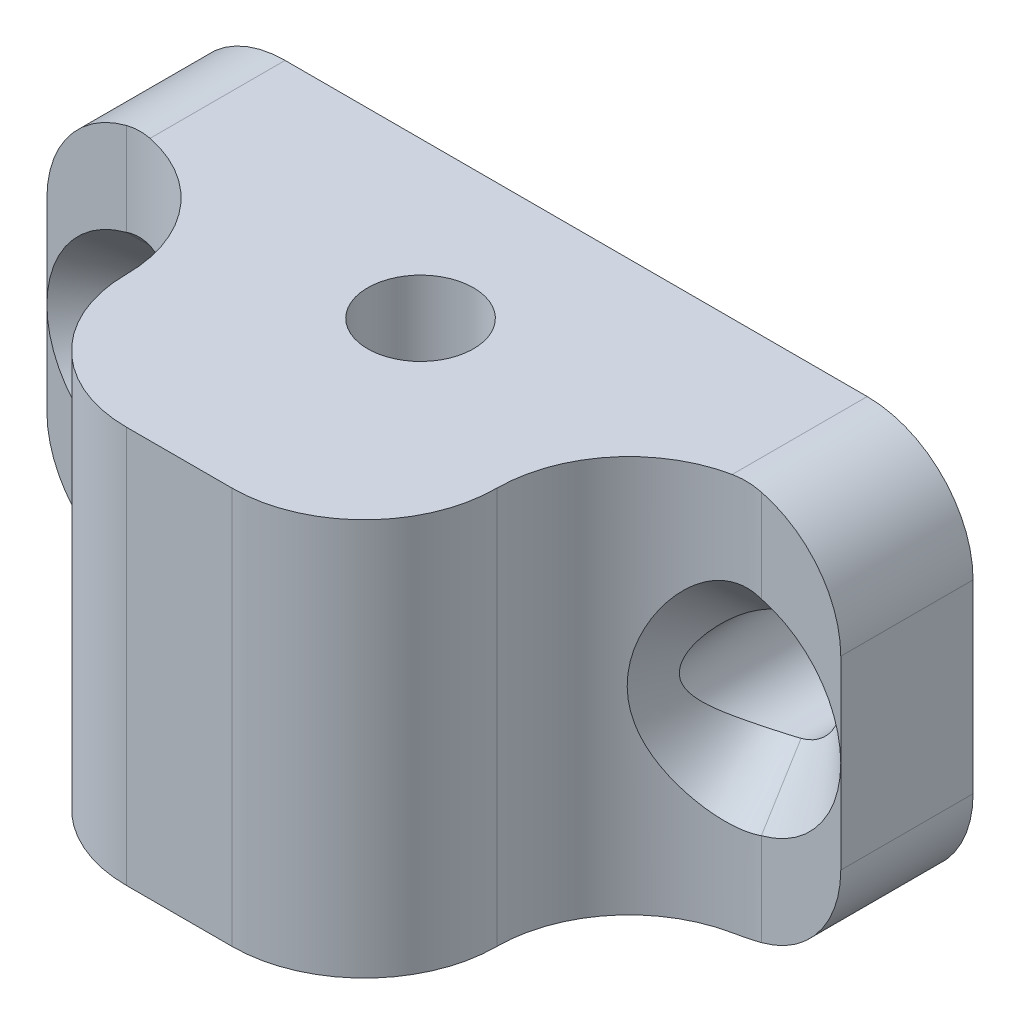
ISO-10303-21;
HEADER;
FILE_DESCRIPTION(('STEP AP214'),'2;1');
FILE_NAME('part.step','',(''),(''),'','','');
FILE_SCHEMA(('AUTOMOTIVE_DESIGN { 1 0 10303 214 1 1 1 1 }'));
ENDSEC;
DATA;
#1=APPLICATION_CONTEXT('core data for automotive mechanical design processes');
#2=APPLICATION_PROTOCOL_DEFINITION('international standard','automotive_design',2000,#1);
#3=PRODUCT_CONTEXT('',#1,'mechanical');
#4=PRODUCT('Part','Part','',(#3));
#5=PRODUCT_RELATED_PRODUCT_CATEGORY('part','',(#4));
#6=PRODUCT_DEFINITION_FORMATION('','',#4);
#7=PRODUCT_DEFINITION_CONTEXT('part definition',#1,'design');
#8=PRODUCT_DEFINITION('design','',#6,#7);
#9=PRODUCT_DEFINITION_SHAPE('','',#8);
#10=(LENGTH_UNIT() NAMED_UNIT(*) SI_UNIT(.MILLI.,.METRE.));
#11=(NAMED_UNIT(*) PLANE_ANGLE_UNIT() SI_UNIT($,.RADIAN.));
#12=(NAMED_UNIT(*) SI_UNIT($,.STERADIAN.) SOLID_ANGLE_UNIT());
#13=UNCERTAINTY_MEASURE_WITH_UNIT(LENGTH_MEASURE(1.E-05),#10,'distance_accuracy_value','');
#14=(GEOMETRIC_REPRESENTATION_CONTEXT(3) GLOBAL_UNCERTAINTY_ASSIGNED_CONTEXT((#13)) GLOBAL_UNIT_ASSIGNED_CONTEXT((#10,
#11,#12)) REPRESENTATION_CONTEXT('',''));
#15=CARTESIAN_POINT('',(0.,0.,0.));
#16=DIRECTION('',(0.,0.,1.));
#17=DIRECTION('',(1.,0.,0.));
#18=AXIS2_PLACEMENT_3D('',#15,#16,#17);
#19=CARTESIAN_POINT('',(0.,0.,5.));
#20=DIRECTION('',(0.,0.,-1.));
#21=DIRECTION('',(-1.,0.,0.));
#22=AXIS2_PLACEMENT_3D('',#19,#20,#21);
#23=PLANE('',#22);
#24=DIRECTION('',(0.,1.,0.));
#25=VECTOR('',#24,1.);
#26=CARTESIAN_POINT('',(30.,0.,5.));
#27=LINE('',#26,#25);
#28=CARTESIAN_POINT('',(30.,7.5,5.));
#29=VERTEX_POINT('',#28);
#30=CARTESIAN_POINT('',(30.,11.,5.));
#31=VERTEX_POINT('',#30);
#32=EDGE_CURVE('E376',#29,#31,#27,.T.);
#33=ORIENTED_EDGE('',*,*,#32,.T.);
#34=CARTESIAN_POINT('',(26.,11.,5.));
#35=DIRECTION('',(0.,0.,-1.));
#36=DIRECTION('',(-1.,0.,0.));
#37=AXIS2_PLACEMENT_3D('',#34,#35,#36);
#38=CIRCLE('',#37,4.);
#39=CARTESIAN_POINT('',(27.,14.8729833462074,5.));
#40=VERTEX_POINT('',#39);
#41=EDGE_CURVE('E67',#31,#40,#38,.F.);
#42=ORIENTED_EDGE('',*,*,#41,.T.);
#43=DIRECTION('',(0.,1.,0.));
#44=VECTOR('',#43,1.);
#45=CARTESIAN_POINT('',(27.,0.,5.));
#46=LINE('',#45,#44);
#47=CARTESIAN_POINT('',(27.,11.3729789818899,5.));
#48=VERTEX_POINT('',#47);
#49=EDGE_CURVE('E190',#40,#48,#46,.F.);
#50=ORIENTED_EDGE('',*,*,#49,.T.);
#51=CARTESIAN_POINT('',(26.,7.5,5.));
#52=DIRECTION('',(0.,0.,-1.));
#53=DIRECTION('',(-1.,0.,0.));
#54=AXIS2_PLACEMENT_3D('',#51,#52,#53);
#55=CIRCLE('',#54,3.99999577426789);
#56=EDGE_CURVE('E308',#48,#29,#55,.T.);
#57=ORIENTED_EDGE('',*,*,#56,.T.);
#58=EDGE_LOOP('',(#33,#42,#50,#57));
#59=FACE_BOUND('',#58,.T.);
#60=ADVANCED_FACE('F42',(#59),#23,.F.);
#61=DIRECTION('',(0.,-1.,0.));
#62=VECTOR('',#61,1.);
#63=CARTESIAN_POINT('',(0.,0.,5.));
#64=LINE('',#63,#62);
#65=CARTESIAN_POINT('',(0.,7.5,5.));
#66=VERTEX_POINT('',#65);
#67=CARTESIAN_POINT('',(0.,4.,5.));
#68=VERTEX_POINT('',#67);
#69=EDGE_CURVE('E588',#66,#68,#64,.T.);
#70=ORIENTED_EDGE('',*,*,#69,.T.);
#71=CARTESIAN_POINT('',(4.,4.,5.));
#72=DIRECTION('',(0.,0.,-1.));
#73=DIRECTION('',(-1.,0.,0.));
#74=AXIS2_PLACEMENT_3D('',#71,#72,#73);
#75=CIRCLE('',#74,4.);
#76=CARTESIAN_POINT('',(3.,0.127016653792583,5.));
#77=VERTEX_POINT('',#76);
#78=EDGE_CURVE('E258',#68,#77,#75,.F.);
#79=ORIENTED_EDGE('',*,*,#78,.T.);
#80=DIRECTION('',(0.,-1.,0.));
#81=VECTOR('',#80,1.);
#82=CARTESIAN_POINT('',(3.,15.,5.));
#83=LINE('',#82,#81);
#84=CARTESIAN_POINT('',(3.,3.62701954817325,5.));
#85=VERTEX_POINT('',#84);
#86=EDGE_CURVE('E241',#77,#85,#83,.F.);
#87=ORIENTED_EDGE('',*,*,#86,.T.);
#88=CARTESIAN_POINT('',(4.,7.5,5.));
#89=DIRECTION('',(0.,0.,-1.));
#90=DIRECTION('',(-1.,0.,0.));
#91=AXIS2_PLACEMENT_3D('',#88,#89,#90);
#92=CIRCLE('',#91,3.99999719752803);
#93=EDGE_CURVE('E594',#85,#66,#92,.T.);
#94=ORIENTED_EDGE('',*,*,#93,.T.);
#95=EDGE_LOOP('',(#70,#79,#87,#94));
#96=FACE_BOUND('',#95,.T.);
#97=ADVANCED_FACE('F350',(#96),#23,.F.);
#98=CARTESIAN_POINT('',(3.,11.3729804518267,5.));
#99=VERTEX_POINT('',#98);
#100=CARTESIAN_POINT('',(3.,14.8729833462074,5.));
#101=VERTEX_POINT('',#100);
#102=EDGE_CURVE('E236',#99,#101,#83,.F.);
#103=ORIENTED_EDGE('',*,*,#102,.T.);
#104=CARTESIAN_POINT('',(4.,11.,5.));
#105=DIRECTION('',(0.,0.,-1.));
#106=DIRECTION('',(-1.,0.,0.));
#107=AXIS2_PLACEMENT_3D('',#104,#105,#106);
#108=CIRCLE('',#107,4.);
#109=CARTESIAN_POINT('',(0.,11.,5.));
#110=VERTEX_POINT('',#109);
#111=EDGE_CURVE('E608',#101,#110,#108,.F.);
#112=ORIENTED_EDGE('',*,*,#111,.T.);
#113=EDGE_CURVE('E380',#110,#66,#64,.T.);
#114=ORIENTED_EDGE('',*,*,#113,.T.);
#115=CARTESIAN_POINT('',(4.,7.5,5.));
#116=DIRECTION('',(0.,0.,-1.));
#117=DIRECTION('',(-1.,0.,0.));
#118=AXIS2_PLACEMENT_3D('',#115,#116,#117);
#119=CIRCLE('',#118,3.99999719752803);
#120=EDGE_CURVE('E228',#66,#99,#119,.T.);
#121=ORIENTED_EDGE('',*,*,#120,.T.);
#122=EDGE_LOOP('',(#103,#112,#114,#121));
#123=FACE_BOUND('',#122,.T.);
#124=ADVANCED_FACE('F346',(#123),#23,.F.);
#125=CARTESIAN_POINT('',(27.,3.6270210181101,5.));
#126=VERTEX_POINT('',#125);
#127=CARTESIAN_POINT('',(27.,0.127016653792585,5.));
#128=VERTEX_POINT('',#127);
#129=EDGE_CURVE('E255',#126,#128,#46,.F.);
#130=ORIENTED_EDGE('',*,*,#129,.T.);
#131=CARTESIAN_POINT('',(26.,4.,5.));
#132=DIRECTION('',(0.,0.,-1.));
#133=DIRECTION('',(-1.,0.,0.));
#134=AXIS2_PLACEMENT_3D('',#131,#132,#133);
#135=CIRCLE('',#134,4.);
#136=CARTESIAN_POINT('',(30.,4.,5.));
#137=VERTEX_POINT('',#136);
#138=EDGE_CURVE('E12',#128,#137,#135,.F.);
#139=ORIENTED_EDGE('',*,*,#138,.T.);
#140=EDGE_CURVE('E242',#137,#29,#27,.T.);
#141=ORIENTED_EDGE('',*,*,#140,.T.);
#142=CARTESIAN_POINT('',(26.,7.5,5.));
#143=DIRECTION('',(0.,0.,-1.));
#144=DIRECTION('',(-1.,0.,0.));
#145=AXIS2_PLACEMENT_3D('',#142,#143,#144);
#146=CIRCLE('',#145,3.99999577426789);
#147=EDGE_CURVE('E305',#29,#126,#146,.T.);
#148=ORIENTED_EDGE('',*,*,#147,.T.);
#149=EDGE_LOOP('',(#130,#139,#141,#148));
#150=FACE_BOUND('',#149,.T.);
#151=ADVANCED_FACE('F349',(#150),#23,.F.);
#152=CARTESIAN_POINT('',(0.,0.,5.));
#153=DIRECTION('',(1.,0.,0.));
#154=DIRECTION('',(0.,0.,-1.));
#155=AXIS2_PLACEMENT_3D('',#152,#153,#154);
#156=PLANE('',#155);
#157=DIRECTION('',(0.,-1.,0.));
#158=VECTOR('',#157,1.);
#159=CARTESIAN_POINT('',(0.,0.,0.));
#160=LINE('',#159,#158);
#161=CARTESIAN_POINT('',(0.,11.,0.));
#162=VERTEX_POINT('',#161);
#163=CARTESIAN_POINT('',(0.,4.,0.));
#164=VERTEX_POINT('',#163);
#165=EDGE_CURVE('E589',#162,#164,#160,.T.);
#166=ORIENTED_EDGE('',*,*,#165,.T.);
#167=DIRECTION('',(0.,0.,-1.));
#168=VECTOR('',#167,1.);
#169=CARTESIAN_POINT('',(0.,4.,5.));
#170=LINE('',#169,#168);
#171=EDGE_CURVE('E256',#164,#68,#170,.F.);
#172=ORIENTED_EDGE('',*,*,#171,.T.);
#173=ORIENTED_EDGE('',*,*,#69,.F.);
#174=ORIENTED_EDGE('',*,*,#113,.F.);
#175=DIRECTION('',(0.,0.,-1.));
#176=VECTOR('',#175,1.);
#177=CARTESIAN_POINT('',(0.,11.,5.));
#178=LINE('',#177,#176);
#179=EDGE_CURVE('E577',#110,#162,#178,.T.);
#180=ORIENTED_EDGE('',*,*,#179,.T.);
#181=EDGE_LOOP('',(#166,#172,#173,#174,#180));
#182=FACE_BOUND('',#181,.T.);
#183=ADVANCED_FACE('F286',(#182),#156,.F.);
#184=CARTESIAN_POINT('',(0.,0.,5.));
#185=DIRECTION('',(0.,1.,0.));
#186=DIRECTION('',(0.,0.,1.));
#187=AXIS2_PLACEMENT_3D('',#184,#185,#186);
#188=PLANE('',#187);
#189=CARTESIAN_POINT('',(15.,0.,5.88));
#190=DIRECTION('',(0.,-1.,0.));
#191=DIRECTION('',(0.,0.,-1.));
#192=AXIS2_PLACEMENT_3D('',#189,#190,#191);
#193=CIRCLE('',#192,2.);
#194=CARTESIAN_POINT('',(15.,0.,3.88));
#195=VERTEX_POINT('',#194);
#196=EDGE_CURVE('E643',#195,#195,#193,.T.);
#197=ORIENTED_EDGE('',*,*,#196,.F.);
#198=EDGE_LOOP('',(#197));
#199=FACE_BOUND('',#198,.T.);
#200=CARTESIAN_POINT('',(3.,0.,10.));
#201=DIRECTION('',(0.,1.,0.));
#202=DIRECTION('',(0.,0.,1.));
#203=AXIS2_PLACEMENT_3D('',#200,#201,#202);
#204=CIRCLE('',#203,5.);
#205=CARTESIAN_POINT('',(8.,0.,10.));
#206=VERTEX_POINT('',#205);
#207=CARTESIAN_POINT('',(4.,0.,5.10102051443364));
#208=VERTEX_POINT('',#207);
#209=EDGE_CURVE('E210',#206,#208,#204,.T.);
#210=ORIENTED_EDGE('',*,*,#209,.T.);
#211=DIRECTION('',(0.,0.,-1.));
#212=VECTOR('',#211,1.);
#213=CARTESIAN_POINT('',(4.,0.,5.));
#214=LINE('',#213,#212);
#215=CARTESIAN_POINT('',(4.,0.,0.));
#216=VERTEX_POINT('',#215);
#217=EDGE_CURVE('E562',#208,#216,#214,.T.);
#218=ORIENTED_EDGE('',*,*,#217,.T.);
#219=DIRECTION('',(1.,0.,0.));
#220=VECTOR('',#219,1.);
#221=CARTESIAN_POINT('',(0.,0.,0.));
#222=LINE('',#221,#220);
#223=CARTESIAN_POINT('',(26.,0.,0.));
#224=VERTEX_POINT('',#223);
#225=EDGE_CURVE('E625',#216,#224,#222,.T.);
#226=ORIENTED_EDGE('',*,*,#225,.T.);
#227=DIRECTION('',(0.,0.,-1.));
#228=VECTOR('',#227,1.);
#229=CARTESIAN_POINT('',(26.,0.,5.));
#230=LINE('',#229,#228);
#231=CARTESIAN_POINT('',(26.,0.,5.10102051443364));
#232=VERTEX_POINT('',#231);
#233=EDGE_CURVE('E554',#224,#232,#230,.F.);
#234=ORIENTED_EDGE('',*,*,#233,.T.);
#235=CARTESIAN_POINT('',(27.,0.,10.));
#236=DIRECTION('',(0.,1.,0.));
#237=DIRECTION('',(0.,0.,1.));
#238=AXIS2_PLACEMENT_3D('',#235,#236,#237);
#239=CIRCLE('',#238,5.);
#240=CARTESIAN_POINT('',(22.,0.,10.));
#241=VERTEX_POINT('',#240);
#242=EDGE_CURVE('E225',#232,#241,#239,.T.);
#243=ORIENTED_EDGE('',*,*,#242,.T.);
#244=CARTESIAN_POINT('',(17.,0.,10.));
#245=DIRECTION('',(0.,1.,0.));
#246=DIRECTION('',(0.,0.,1.));
#247=AXIS2_PLACEMENT_3D('',#244,#245,#246);
#248=CIRCLE('',#247,5.);
#249=CARTESIAN_POINT('',(17.,0.,15.));
#250=VERTEX_POINT('',#249);
#251=EDGE_CURVE('E198',#241,#250,#248,.F.);
#252=ORIENTED_EDGE('',*,*,#251,.T.);
#253=DIRECTION('',(1.,0.,0.));
#254=VECTOR('',#253,1.);
#255=CARTESIAN_POINT('',(8.,0.,15.));
#256=LINE('',#255,#254);
#257=CARTESIAN_POINT('',(13.,0.,15.));
#258=VERTEX_POINT('',#257);
#259=EDGE_CURVE('E181',#258,#250,#256,.T.);
#260=ORIENTED_EDGE('',*,*,#259,.F.);
#261=CARTESIAN_POINT('',(13.,0.,10.));
#262=DIRECTION('',(0.,1.,0.));
#263=DIRECTION('',(0.,0.,1.));
#264=AXIS2_PLACEMENT_3D('',#261,#262,#263);
#265=CIRCLE('',#264,5.);
#266=EDGE_CURVE('E195',#258,#206,#265,.F.);
#267=ORIENTED_EDGE('',*,*,#266,.T.);
#268=EDGE_LOOP('',(#210,#218,#226,#234,#243,#252,#260,#267));
#269=FACE_BOUND('',#268,.T.);
#270=ADVANCED_FACE('F194',(#199,#269),#188,.F.);
#271=CARTESIAN_POINT('',(30.,0.,5.));
#272=DIRECTION('',(-1.,0.,0.));
#273=DIRECTION('',(0.,0.,1.));
#274=AXIS2_PLACEMENT_3D('',#271,#272,#273);
#275=PLANE('',#274);
#276=DIRECTION('',(0.,1.,0.));
#277=VECTOR('',#276,1.);
#278=CARTESIAN_POINT('',(30.,0.,0.));
#279=LINE('',#278,#277);
#280=CARTESIAN_POINT('',(30.,4.,0.));
#281=VERTEX_POINT('',#280);
#282=CARTESIAN_POINT('',(30.,11.,0.));
#283=VERTEX_POINT('',#282);
#284=EDGE_CURVE('E618',#281,#283,#279,.T.);
#285=ORIENTED_EDGE('',*,*,#284,.T.);
#286=DIRECTION('',(0.,0.,-1.));
#287=VECTOR('',#286,1.);
#288=CARTESIAN_POINT('',(30.,11.,5.));
#289=LINE('',#288,#287);
#290=EDGE_CURVE('E386',#283,#31,#289,.F.);
#291=ORIENTED_EDGE('',*,*,#290,.T.);
#292=ORIENTED_EDGE('',*,*,#32,.F.);
#293=ORIENTED_EDGE('',*,*,#140,.F.);
#294=DIRECTION('',(0.,0.,-1.));
#295=VECTOR('',#294,1.);
#296=CARTESIAN_POINT('',(30.,4.,5.));
#297=LINE('',#296,#295);
#298=EDGE_CURVE('E393',#137,#281,#297,.T.);
#299=ORIENTED_EDGE('',*,*,#298,.T.);
#300=EDGE_LOOP('',(#285,#291,#292,#293,#299));
#301=FACE_BOUND('',#300,.T.);
#302=ADVANCED_FACE('F358',(#301),#275,.F.);
#303=CARTESIAN_POINT('',(0.,15.,5.));
#304=DIRECTION('',(0.,-1.,0.));
#305=DIRECTION('',(0.,0.,-1.));
#306=AXIS2_PLACEMENT_3D('',#303,#304,#305);
#307=PLANE('',#306);
#308=CARTESIAN_POINT('',(15.,15.,5.88));
#309=DIRECTION('',(0.,-1.,0.));
#310=DIRECTION('',(0.,0.,-1.));
#311=AXIS2_PLACEMENT_3D('',#308,#309,#310);
#312=CIRCLE('',#311,2.);
#313=CARTESIAN_POINT('',(15.,15.,3.88));
#314=VERTEX_POINT('',#313);
#315=EDGE_CURVE('E647',#314,#314,#312,.T.);
#316=ORIENTED_EDGE('',*,*,#315,.T.);
#317=EDGE_LOOP('',(#316));
#318=FACE_BOUND('',#317,.T.);
#319=DIRECTION('',(-1.,0.,0.));
#320=VECTOR('',#319,1.);
#321=CARTESIAN_POINT('',(0.,15.,0.));
#322=LINE('',#321,#320);
#323=CARTESIAN_POINT('',(26.,15.,0.));
#324=VERTEX_POINT('',#323);
#325=CARTESIAN_POINT('',(4.,15.,0.));
#326=VERTEX_POINT('',#325);
#327=EDGE_CURVE('E247',#324,#326,#322,.T.);
#328=ORIENTED_EDGE('',*,*,#327,.T.);
#329=DIRECTION('',(0.,0.,-1.));
#330=VECTOR('',#329,1.);
#331=CARTESIAN_POINT('',(4.,15.,5.));
#332=LINE('',#331,#330);
#333=CARTESIAN_POINT('',(4.,15.,5.10102051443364));
#334=VERTEX_POINT('',#333);
#335=EDGE_CURVE('E603',#326,#334,#332,.F.);
#336=ORIENTED_EDGE('',*,*,#335,.T.);
#337=CARTESIAN_POINT('',(3.,15.,10.));
#338=DIRECTION('',(0.,-1.,0.));
#339=DIRECTION('',(0.,0.,-1.));
#340=AXIS2_PLACEMENT_3D('',#337,#338,#339);
#341=CIRCLE('',#340,5.);
#342=CARTESIAN_POINT('',(8.,15.,10.));
#343=VERTEX_POINT('',#342);
#344=EDGE_CURVE('E218',#334,#343,#341,.T.);
#345=ORIENTED_EDGE('',*,*,#344,.T.);
#346=CARTESIAN_POINT('',(13.,15.,10.));
#347=DIRECTION('',(0.,-1.,0.));
#348=DIRECTION('',(0.,0.,-1.));
#349=AXIS2_PLACEMENT_3D('',#346,#347,#348);
#350=CIRCLE('',#349,5.);
#351=CARTESIAN_POINT('',(13.,15.,15.));
#352=VERTEX_POINT('',#351);
#353=EDGE_CURVE('E212',#343,#352,#350,.F.);
#354=ORIENTED_EDGE('',*,*,#353,.T.);
#355=DIRECTION('',(-1.,0.,0.));
#356=VECTOR('',#355,1.);
#357=CARTESIAN_POINT('',(8.,15.,15.));
#358=LINE('',#357,#356);
#359=CARTESIAN_POINT('',(17.,15.,15.));
#360=VERTEX_POINT('',#359);
#361=EDGE_CURVE('E184',#360,#352,#358,.T.);
#362=ORIENTED_EDGE('',*,*,#361,.F.);
#363=CARTESIAN_POINT('',(17.,15.,10.));
#364=DIRECTION('',(0.,-1.,0.));
#365=DIRECTION('',(0.,0.,-1.));
#366=AXIS2_PLACEMENT_3D('',#363,#364,#365);
#367=CIRCLE('',#366,5.);
#368=CARTESIAN_POINT('',(22.,15.,10.));
#369=VERTEX_POINT('',#368);
#370=EDGE_CURVE('E206',#360,#369,#367,.F.);
#371=ORIENTED_EDGE('',*,*,#370,.T.);
#372=CARTESIAN_POINT('',(27.,15.,10.));
#373=DIRECTION('',(0.,-1.,0.));
#374=DIRECTION('',(0.,0.,-1.));
#375=AXIS2_PLACEMENT_3D('',#372,#373,#374);
#376=CIRCLE('',#375,5.);
#377=CARTESIAN_POINT('',(26.,15.,5.10102051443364));
#378=VERTEX_POINT('',#377);
#379=EDGE_CURVE('E221',#369,#378,#376,.T.);
#380=ORIENTED_EDGE('',*,*,#379,.T.);
#381=DIRECTION('',(0.,0.,-1.));
#382=VECTOR('',#381,1.);
#383=CARTESIAN_POINT('',(26.,15.,5.));
#384=LINE('',#383,#382);
#385=EDGE_CURVE('E600',#378,#324,#384,.T.);
#386=ORIENTED_EDGE('',*,*,#385,.T.);
#387=EDGE_LOOP('',(#328,#336,#345,#354,#362,#371,#380,#386));
#388=FACE_BOUND('',#387,.T.);
#389=ADVANCED_FACE('F354',(#318,#388),#307,.F.);
#390=CARTESIAN_POINT('',(0.,0.,0.));
#391=DIRECTION('',(0.,0.,-1.));
#392=DIRECTION('',(-1.,0.,0.));
#393=AXIS2_PLACEMENT_3D('',#390,#391,#392);
#394=PLANE('',#393);
#395=CARTESIAN_POINT('',(4.,7.5,0.));
#396=DIRECTION('',(0.,0.,-1.));
#397=DIRECTION('',(-1.,0.,0.));
#398=AXIS2_PLACEMENT_3D('',#395,#396,#397);
#399=CIRCLE('',#398,2.);
#400=CARTESIAN_POINT('',(2.,7.5,0.));
#401=VERTEX_POINT('',#400);
#402=EDGE_CURVE('E235',#401,#401,#399,.T.);
#403=ORIENTED_EDGE('',*,*,#402,.F.);
#404=EDGE_LOOP('',(#403));
#405=FACE_BOUND('',#404,.T.);
#406=CARTESIAN_POINT('',(26.,7.5,0.));
#407=DIRECTION('',(0.,0.,-1.));
#408=DIRECTION('',(-1.,0.,0.));
#409=AXIS2_PLACEMENT_3D('',#406,#407,#408);
#410=CIRCLE('',#409,2.);
#411=CARTESIAN_POINT('',(24.,7.5,0.));
#412=VERTEX_POINT('',#411);
#413=EDGE_CURVE('E636',#412,#412,#410,.T.);
#414=ORIENTED_EDGE('',*,*,#413,.F.);
#415=EDGE_LOOP('',(#414));
#416=FACE_BOUND('',#415,.T.);
#417=ORIENTED_EDGE('',*,*,#225,.F.);
#418=CARTESIAN_POINT('',(4.,4.,0.));
#419=DIRECTION('',(0.,0.,-1.));
#420=DIRECTION('',(-1.,0.,0.));
#421=AXIS2_PLACEMENT_3D('',#418,#419,#420);
#422=CIRCLE('',#421,4.);
#423=EDGE_CURVE('E575',#216,#164,#422,.T.);
#424=ORIENTED_EDGE('',*,*,#423,.T.);
#425=ORIENTED_EDGE('',*,*,#165,.F.);
#426=CARTESIAN_POINT('',(4.,11.,0.));
#427=DIRECTION('',(0.,0.,-1.));
#428=DIRECTION('',(-1.,0.,0.));
#429=AXIS2_PLACEMENT_3D('',#426,#427,#428);
#430=CIRCLE('',#429,4.);
#431=EDGE_CURVE('E572',#162,#326,#430,.T.);
#432=ORIENTED_EDGE('',*,*,#431,.T.);
#433=ORIENTED_EDGE('',*,*,#327,.F.);
#434=CARTESIAN_POINT('',(26.,11.,0.));
#435=DIRECTION('',(0.,0.,-1.));
#436=DIRECTION('',(-1.,0.,0.));
#437=AXIS2_PLACEMENT_3D('',#434,#435,#436);
#438=CIRCLE('',#437,4.);
#439=EDGE_CURVE('E569',#324,#283,#438,.T.);
#440=ORIENTED_EDGE('',*,*,#439,.T.);
#441=ORIENTED_EDGE('',*,*,#284,.F.);
#442=CARTESIAN_POINT('',(26.,4.,0.));
#443=DIRECTION('',(0.,0.,-1.));
#444=DIRECTION('',(-1.,0.,0.));
#445=AXIS2_PLACEMENT_3D('',#442,#443,#444);
#446=CIRCLE('',#445,4.);
#447=EDGE_CURVE('E566',#281,#224,#446,.T.);
#448=ORIENTED_EDGE('',*,*,#447,.T.);
#449=EDGE_LOOP('',(#417,#424,#425,#432,#433,#440,#441,#448));
#450=FACE_BOUND('',#449,.T.);
#451=ADVANCED_FACE('F345',(#405,#416,#450),#394,.T.);
#452=CARTESIAN_POINT('',(0.,0.,15.));
#453=DIRECTION('',(0.,0.,1.));
#454=DIRECTION('',(1.,0.,0.));
#455=AXIS2_PLACEMENT_3D('',#452,#453,#454);
#456=PLANE('',#455);
#457=ORIENTED_EDGE('',*,*,#259,.T.);
#458=DIRECTION('',(0.,1.,0.));
#459=VECTOR('',#458,1.);
#460=CARTESIAN_POINT('',(17.,15.,15.));
#461=LINE('',#460,#459);
#462=EDGE_CURVE('E189',#250,#360,#461,.T.);
#463=ORIENTED_EDGE('',*,*,#462,.T.);
#464=ORIENTED_EDGE('',*,*,#361,.T.);
#465=DIRECTION('',(0.,-1.,0.));
#466=VECTOR('',#465,1.);
#467=CARTESIAN_POINT('',(13.,0.,15.));
#468=LINE('',#467,#466);
#469=EDGE_CURVE('E178',#352,#258,#468,.T.);
#470=ORIENTED_EDGE('',*,*,#469,.T.);
#471=EDGE_LOOP('',(#457,#463,#464,#470));
#472=FACE_BOUND('',#471,.T.);
#473=ADVANCED_FACE('F180',(#472),#456,.T.);
#474=CARTESIAN_POINT('',(13.,0.,10.));
#475=DIRECTION('',(0.,1.,0.));
#476=DIRECTION('',(-1.,0.,0.));
#477=AXIS2_PLACEMENT_3D('',#474,#475,#476);
#478=CYLINDRICAL_SURFACE('',#477,5.);
#479=ORIENTED_EDGE('',*,*,#469,.F.);
#480=ORIENTED_EDGE('',*,*,#353,.F.);
#481=DIRECTION('',(0.,-1.,0.));
#482=VECTOR('',#481,1.);
#483=CARTESIAN_POINT('',(8.,15.,10.));
#484=LINE('',#483,#482);
#485=EDGE_CURVE('E200',#206,#343,#484,.F.);
#486=ORIENTED_EDGE('',*,*,#485,.F.);
#487=ORIENTED_EDGE('',*,*,#266,.F.);
#488=EDGE_LOOP('',(#479,#480,#486,#487));
#489=FACE_BOUND('',#488,.T.);
#490=ADVANCED_FACE('F202',(#489),#478,.T.);
#491=CARTESIAN_POINT('',(3.,15.,10.));
#492=DIRECTION('',(0.,1.,0.));
#493=DIRECTION('',(-1.,0.,0.));
#494=AXIS2_PLACEMENT_3D('',#491,#492,#493);
#495=CYLINDRICAL_SURFACE('',#494,5.);
#496=ORIENTED_EDGE('',*,*,#86,.F.);
#497=CARTESIAN_POINT('',(3.,0.127016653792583,5.));
#498=CARTESIAN_POINT('',(3.08235942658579,0.105738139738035,4.9999869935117));
#499=CARTESIAN_POINT('',(3.16540780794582,0.0871109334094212,5.00203498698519));
#500=CARTESIAN_POINT('',(3.33177599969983,0.0553102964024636,5.01033221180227));
#501=CARTESIAN_POINT('',(3.4150905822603,0.0421023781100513,5.0165541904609));
#502=CARTESIAN_POINT('',(3.58196447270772,0.0210152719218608,5.03327590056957));
#503=CARTESIAN_POINT('',(3.66552378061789,0.0131360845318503,5.04377563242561));
#504=CARTESIAN_POINT('',(3.83287134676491,0.00260482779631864,5.06912101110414));
#505=CARTESIAN_POINT('',(3.91665755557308,-1.28875080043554E-05,5.08399449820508));
#506=CARTESIAN_POINT('',(4.,0.,5.10102051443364));
#507=B_SPLINE_CURVE_WITH_KNOTS('',3,(#497,#498,#499,#500,#501,#502,#503,#504,#505,#506),
.UNSPECIFIED.,.F.,.F.,(4,2,2,2,4),(0.,0.255128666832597,0.508607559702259,0.762086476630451,
1.01721514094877),.UNSPECIFIED.);
#508=EDGE_CURVE('E270',#77,#208,#507,.T.);
#509=ORIENTED_EDGE('',*,*,#508,.T.);
#510=ORIENTED_EDGE('',*,*,#209,.F.);
#511=ORIENTED_EDGE('',*,*,#485,.T.);
#512=ORIENTED_EDGE('',*,*,#344,.F.);
#513=CARTESIAN_POINT('',(4.,15.,5.10102051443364));
#514=CARTESIAN_POINT('',(3.91665755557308,15.000012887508,5.08399449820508));
#515=CARTESIAN_POINT('',(3.83287134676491,14.9973951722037,5.06912101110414));
#516=CARTESIAN_POINT('',(3.66552378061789,14.9868639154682,5.04377563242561));
#517=CARTESIAN_POINT('',(3.58196447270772,14.9789847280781,5.03327590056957));
#518=CARTESIAN_POINT('',(3.4150905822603,14.9578976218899,5.0165541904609));
#519=CARTESIAN_POINT('',(3.33177599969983,14.9446897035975,5.01033221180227));
#520=CARTESIAN_POINT('',(3.16540780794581,14.9128890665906,5.00203498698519));
#521=CARTESIAN_POINT('',(3.08235942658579,14.894261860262,4.9999869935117));
#522=CARTESIAN_POINT('',(3.,14.8729833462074,5.));
#523=B_SPLINE_CURVE_WITH_KNOTS('',3,(#513,#514,#515,#516,#517,#518,#519,#520,#521,#522),
.UNSPECIFIED.,.F.,.F.,(4,2,2,2,4),(0.,0.255128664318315,0.508607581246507,0.762086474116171,
1.01721514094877),.UNSPECIFIED.);
#524=EDGE_CURVE('E261',#334,#101,#523,.T.);
#525=ORIENTED_EDGE('',*,*,#524,.T.);
#526=ORIENTED_EDGE('',*,*,#102,.F.);
#527=CARTESIAN_POINT('',(3.,3.62701954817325,5.));
#528=CARTESIAN_POINT('',(3.11149649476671,3.58672407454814,5.00000073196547));
#529=CARTESIAN_POINT('',(3.2233793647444,3.55630079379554,5.00372590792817));
#530=CARTESIAN_POINT('',(3.44783440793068,3.51428107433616,5.01882591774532));
#531=CARTESIAN_POINT('',(3.56054285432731,3.50271013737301,5.03023037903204));
#532=CARTESIAN_POINT('',(3.78606689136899,3.49811844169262,5.0608523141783));
#533=CARTESIAN_POINT('',(3.90025938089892,3.50538987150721,5.08039206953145));
#534=CARTESIAN_POINT('',(4.12261335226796,3.53799955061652,5.12634565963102));
#535=CARTESIAN_POINT('',(4.23165935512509,3.56314258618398,5.15280288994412));
#536=CARTESIAN_POINT('',(4.44543292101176,3.63015137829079,5.21219960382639));
#537=CARTESIAN_POINT('',(4.550104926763,3.67195433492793,5.245104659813));
#538=CARTESIAN_POINT('',(4.70440404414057,3.74708614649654,5.29915017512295));
#539=CARTESIAN_POINT('',(4.75528917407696,3.77419200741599,5.31792636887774));
#540=CARTESIAN_POINT('',(4.85470400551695,3.83168431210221,5.35641283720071));
#541=CARTESIAN_POINT('',(4.90349920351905,3.86219507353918,5.37621408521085));
#542=CARTESIAN_POINT('',(5.04684644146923,3.95859409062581,5.43697805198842));
#543=CARTESIAN_POINT('',(5.13873914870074,4.02951177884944,5.47943168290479));
#544=CARTESIAN_POINT('',(5.31552473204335,4.18399469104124,5.56738266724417));
#545=CARTESIAN_POINT('',(5.40050828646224,4.26766306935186,5.61293618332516));
#546=CARTESIAN_POINT('',(5.56365315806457,4.44750119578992,5.70621701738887));
#547=CARTESIAN_POINT('',(5.64238033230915,4.54454446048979,5.75434186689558));
#548=CARTESIAN_POINT('',(5.78999485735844,4.7475423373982,5.84986753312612));
#549=CARTESIAN_POINT('',(5.8595007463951,4.85406419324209,5.89759487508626));
#550=CARTESIAN_POINT('',(5.99004922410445,5.07724263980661,5.99174762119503));
#551=CARTESIAN_POINT('',(6.05116229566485,5.19398548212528,6.0382233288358));
#552=CARTESIAN_POINT('',(6.1365303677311,5.37738701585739,6.10596567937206));
#553=CARTESIAN_POINT('',(6.16397269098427,5.44001527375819,6.12825062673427));
#554=CARTESIAN_POINT('',(6.2166597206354,5.56811044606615,6.17190976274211));
#555=CARTESIAN_POINT('',(6.24201302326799,5.63388749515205,6.19337853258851));
#556=CARTESIAN_POINT('',(6.31412734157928,5.83436088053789,6.25559396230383));
#557=CARTESIAN_POINT('',(6.356887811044,5.97174691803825,6.29407112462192));
#558=CARTESIAN_POINT('',(6.43183199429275,6.25573909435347,6.36336233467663));
#559=CARTESIAN_POINT('',(6.46396334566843,6.40218021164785,6.39412662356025));
#560=CARTESIAN_POINT('',(6.50356364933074,6.62981092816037,6.43273509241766));
#561=CARTESIAN_POINT('',(6.51533655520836,6.70732701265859,6.44435475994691));
#562=CARTESIAN_POINT('',(6.53550797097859,6.86282643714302,6.46441181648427));
#563=CARTESIAN_POINT('',(6.54395964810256,6.94100716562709,6.47289841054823));
#564=CARTESIAN_POINT('',(6.56427274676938,7.17620523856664,6.49338859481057));
#565=CARTESIAN_POINT('',(6.5712537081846,7.33477883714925,6.50055007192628));
#566=CARTESIAN_POINT('',(6.57151125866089,7.57453017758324,6.50081353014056));
#567=CARTESIAN_POINT('',(6.56985847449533,7.65512371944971,6.49912390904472));
#568=CARTESIAN_POINT('',(6.56308719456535,7.81583131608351,6.49223242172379));
#569=CARTESIAN_POINT('',(6.55801505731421,7.89527275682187,6.48707870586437));
#570=CARTESIAN_POINT('',(6.53790016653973,8.13098297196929,6.46678157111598));
#571=CARTESIAN_POINT('',(6.51797695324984,8.28551684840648,6.44681396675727));
#572=CARTESIAN_POINT('',(6.46595519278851,8.58808586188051,6.39604332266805));
#573=CARTESIAN_POINT('',(6.43339327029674,8.73773592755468,6.36483378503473));
#574=CARTESIAN_POINT('',(6.35840060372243,9.02310157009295,6.29544306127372));
#575=CARTESIAN_POINT('',(6.31576427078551,9.16050394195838,6.25705447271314));
#576=CARTESIAN_POINT('',(6.22086420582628,9.42546301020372,6.17508663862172));
#577=CARTESIAN_POINT('',(6.16860016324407,9.55309442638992,6.13150060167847));
#578=CARTESIAN_POINT('',(6.08285053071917,9.7382208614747,6.06332939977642));
#579=CARTESIAN_POINT('',(6.05299782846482,9.79890924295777,6.04011344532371));
#580=CARTESIAN_POINT('',(5.99144254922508,9.91699063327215,5.99341051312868));
#581=CARTESIAN_POINT('',(5.95964771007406,9.97459653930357,5.96984793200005));
#582=CARTESIAN_POINT('',(5.86141915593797,10.1429102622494,5.89892873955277));
#583=CARTESIAN_POINT('',(5.79196357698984,10.2495434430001,5.85119230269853));
#584=CARTESIAN_POINT('',(5.64504225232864,10.451996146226,5.75601509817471));
#585=CARTESIAN_POINT('',(5.56755404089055,10.5478526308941,5.70855202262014));
#586=CARTESIAN_POINT('',(5.44481988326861,10.6836526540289,5.63822330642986));
#587=CARTESIAN_POINT('',(5.40271783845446,10.7276646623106,5.61487517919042));
#588=CARTESIAN_POINT('',(5.31692850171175,10.812276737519,5.56895000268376));
#589=CARTESIAN_POINT('',(5.27321481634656,10.8529249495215,5.54635184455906));
#590=CARTESIAN_POINT('',(5.13973246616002,10.969722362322,5.4798901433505));
#591=CARTESIAN_POINT('',(5.04738056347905,11.0410341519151,5.43720903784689));
#592=CARTESIAN_POINT('',(4.85578310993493,11.1699058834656,5.35598297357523));
#593=CARTESIAN_POINT('',(4.75638139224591,11.2275764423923,5.31736772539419));
#594=CARTESIAN_POINT('',(4.55026275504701,11.3279971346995,5.24514826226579));
#595=CARTESIAN_POINT('',(4.44539103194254,11.3698696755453,5.21218459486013));
#596=CARTESIAN_POINT('',(4.23141810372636,11.4369251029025,5.15273923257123));
#597=CARTESIAN_POINT('',(4.12231505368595,11.4620559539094,5.12627898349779));
#598=CARTESIAN_POINT('',(3.90010880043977,11.4946203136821,5.08036603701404));
#599=CARTESIAN_POINT('',(3.78595993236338,11.5018859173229,5.06083504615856));
#600=CARTESIAN_POINT('',(3.5603834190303,11.4972801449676,5.03021144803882));
#601=CARTESIAN_POINT('',(3.44769946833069,11.4857000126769,5.01881429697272));
#602=CARTESIAN_POINT('',(3.22328888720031,11.443675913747,5.00372236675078));
#603=CARTESIAN_POINT('',(3.11144354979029,11.4132568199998,5.00000073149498));
#604=CARTESIAN_POINT('',(3.,11.3729804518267,5.));
#605=B_SPLINE_CURVE_WITH_KNOTS('',3,(#527,#528,#529,#530,#531,#532,#533,#534,#535,#536,#537,
#538,#539,#540,#541,#542,#543,#544,#545,#546,#547,#548,#549,#550,#551,#552,#553,#554,#555,#556,
#557,#558,#559,#560,#561,#562,#563,#564,#565,#566,#567,#568,#569,#570,#571,#572,#573,#574,#575,
#576,#577,#578,#579,#580,#581,#582,#583,#584,#585,#586,#587,#588,#589,#590,#591,#592,#593,#594,
#595,#596,#597,#598,#599,#600,#601,#602,#603,#604),.UNSPECIFIED.,.F.,.F.,(4,2,2,2,2,2,2,2,2,2,2,
2,2,2,2,2,2,2,2,2,2,2,2,2,2,2,2,2,2,2,2,2,2,2,2,2,2,2,4),(0.,0.000476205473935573,
0.000952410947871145,0.00142861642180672,0.00190482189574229,0.00238102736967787,
0.00261913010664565,0.00285723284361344,0.00333343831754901,0.00380964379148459,
0.00428584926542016,0.00476205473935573,0.00523826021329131,0.00547636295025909,
0.00571446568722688,0.00619067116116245,0.00666687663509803,0.00690497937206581,
0.0071430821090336,0.00761928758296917,0.00785739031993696,0.00809549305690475,
0.00857169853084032,0.00904790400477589,0.00952410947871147,0.010000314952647,
0.0102384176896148,0.0104765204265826,0.0109527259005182,0.0114289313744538,0.0116670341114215,
0.0119051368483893,0.0123813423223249,0.0128575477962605,0.0133337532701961,0.0138099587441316,
0.0142861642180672,0.0147623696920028,0.0152385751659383),.UNSPECIFIED.);
#606=EDGE_CURVE('E309',#99,#85,#605,.F.);
#607=ORIENTED_EDGE('',*,*,#606,.T.);
#608=EDGE_LOOP('',(#496,#509,#510,#511,#512,#525,#526,#607));
#609=FACE_BOUND('',#608,.T.);
#610=ADVANCED_FACE('F279',(#609),#495,.F.);
#611=CARTESIAN_POINT('',(17.,0.,10.));
#612=DIRECTION('',(0.,-1.,0.));
#613=DIRECTION('',(1.,0.,0.));
#614=AXIS2_PLACEMENT_3D('',#611,#612,#613);
#615=CYLINDRICAL_SURFACE('',#614,5.);
#616=ORIENTED_EDGE('',*,*,#462,.F.);
#617=ORIENTED_EDGE('',*,*,#251,.F.);
#618=DIRECTION('',(0.,1.,0.));
#619=VECTOR('',#618,1.);
#620=CARTESIAN_POINT('',(22.,0.,10.));
#621=LINE('',#620,#619);
#622=EDGE_CURVE('E231',#369,#241,#621,.F.);
#623=ORIENTED_EDGE('',*,*,#622,.F.);
#624=ORIENTED_EDGE('',*,*,#370,.F.);
#625=EDGE_LOOP('',(#616,#617,#623,#624));
#626=FACE_BOUND('',#625,.T.);
#627=ADVANCED_FACE('F284',(#626),#615,.T.);
#628=CARTESIAN_POINT('',(27.,15.,10.));
#629=DIRECTION('',(0.,-1.,0.));
#630=DIRECTION('',(1.,0.,0.));
#631=AXIS2_PLACEMENT_3D('',#628,#629,#630);
#632=CYLINDRICAL_SURFACE('',#631,5.);
#633=ORIENTED_EDGE('',*,*,#49,.F.);
#634=CARTESIAN_POINT('',(27.,14.8729833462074,5.));
#635=CARTESIAN_POINT('',(26.9176405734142,14.894261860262,4.9999869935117));
#636=CARTESIAN_POINT('',(26.8345921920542,14.9128890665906,5.00203498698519));
#637=CARTESIAN_POINT('',(26.6682240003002,14.9446897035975,5.01033221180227));
#638=CARTESIAN_POINT('',(26.5849094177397,14.9578976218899,5.0165541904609));
#639=CARTESIAN_POINT('',(26.4180355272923,14.9789847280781,5.03327590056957));
#640=CARTESIAN_POINT('',(26.3344762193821,14.9868639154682,5.04377563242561));
#641=CARTESIAN_POINT('',(26.1671286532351,14.9973951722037,5.06912101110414));
#642=CARTESIAN_POINT('',(26.0833424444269,15.000012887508,5.08399449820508));
#643=CARTESIAN_POINT('',(26.,15.,5.10102051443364));
#644=B_SPLINE_CURVE_WITH_KNOTS('',3,(#634,#635,#636,#637,#638,#639,#640,#641,#642,#643),
.UNSPECIFIED.,.F.,.F.,(4,2,2,2,4),(0.,0.255128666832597,0.508607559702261,0.762086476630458,
1.01721514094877),.UNSPECIFIED.);
#645=EDGE_CURVE('E52',#40,#378,#644,.T.);
#646=ORIENTED_EDGE('',*,*,#645,.T.);
#647=ORIENTED_EDGE('',*,*,#379,.F.);
#648=ORIENTED_EDGE('',*,*,#622,.T.);
#649=ORIENTED_EDGE('',*,*,#242,.F.);
#650=CARTESIAN_POINT('',(26.,0.,5.10102051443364));
#651=CARTESIAN_POINT('',(26.0833424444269,-1.2887508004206E-05,5.08399449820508));
#652=CARTESIAN_POINT('',(26.1671286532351,0.0026048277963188,5.06912101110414));
#653=CARTESIAN_POINT('',(26.3344762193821,0.0131360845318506,5.04377563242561));
#654=CARTESIAN_POINT('',(26.4180355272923,0.0210152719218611,5.03327590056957));
#655=CARTESIAN_POINT('',(26.5849094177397,0.0421023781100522,5.0165541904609));
#656=CARTESIAN_POINT('',(26.6682240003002,0.055310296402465,5.01033221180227));
#657=CARTESIAN_POINT('',(26.8345921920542,0.0871109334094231,5.00203498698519));
#658=CARTESIAN_POINT('',(26.9176405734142,0.105738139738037,4.99998699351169));
#659=CARTESIAN_POINT('',(27.,0.127016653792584,5.));
#660=B_SPLINE_CURVE_WITH_KNOTS('',3,(#650,#651,#652,#653,#654,#655,#656,#657,#658,#659),
.UNSPECIFIED.,.F.,.F.,(4,2,2,2,4),(0.,0.255128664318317,0.508607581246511,0.762086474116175,
1.01721514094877),.UNSPECIFIED.);
#661=EDGE_CURVE('E59',#232,#128,#660,.T.);
#662=ORIENTED_EDGE('',*,*,#661,.T.);
#663=ORIENTED_EDGE('',*,*,#129,.F.);
#664=CARTESIAN_POINT('',(27.,11.3729789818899,5.));
#665=CARTESIAN_POINT('',(26.8885035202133,11.4132744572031,5.0000007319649));
#666=CARTESIAN_POINT('',(26.7766206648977,11.4436977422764,5.00372590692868));
#667=CARTESIAN_POINT('',(26.5521656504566,11.4857174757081,5.01882591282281));
#668=CARTESIAN_POINT('',(26.4394572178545,11.4972884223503,5.03023037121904));
#669=CARTESIAN_POINT('',(26.2139332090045,11.5018801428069,5.06085229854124));
#670=CARTESIAN_POINT('',(26.0997407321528,11.4946087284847,5.08039204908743));
#671=CARTESIAN_POINT('',(25.8773867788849,11.4619990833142,5.12634562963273));
#672=CARTESIAN_POINT('',(25.7683407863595,11.4368560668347,5.15280285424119));
#673=CARTESIAN_POINT('',(25.5545672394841,11.3698473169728,5.21219955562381));
#674=CARTESIAN_POINT('',(25.4498952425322,11.3280443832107,5.24510460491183));
#675=CARTESIAN_POINT('',(25.2955961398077,11.25291261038,5.29915010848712));
#676=CARTESIAN_POINT('',(25.2447110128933,11.2258067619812,5.31792629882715));
#677=CARTESIAN_POINT('',(25.1452961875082,11.168314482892,5.35641276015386));
#678=CARTESIAN_POINT('',(25.0965009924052,11.1378037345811,5.37621400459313));
#679=CARTESIAN_POINT('',(24.953153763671,11.0414047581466,5.43697796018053));
#680=CARTESIAN_POINT('',(24.8612610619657,10.9704870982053,5.47943158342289));
#681=CARTESIAN_POINT('',(24.6844754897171,10.8160042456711,5.56738255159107));
#682=CARTESIAN_POINT('',(24.5994919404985,10.7323358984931,5.61293605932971));
#683=CARTESIAN_POINT('',(24.4363470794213,10.5524978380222,5.70621687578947));
#684=CARTESIAN_POINT('',(24.3576199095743,10.4554546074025,5.75434171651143));
#685=CARTESIAN_POINT('',(24.2100053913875,10.2524567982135,5.84986736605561));
#686=CARTESIAN_POINT('',(24.1404995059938,10.1459349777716,5.89759469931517));
#687=CARTESIAN_POINT('',(24.0099510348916,9.92275660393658,5.99174742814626));
#688=CARTESIAN_POINT('',(23.9488379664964,9.80601379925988,6.03822312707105));
#689=CARTESIAN_POINT('',(23.8634698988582,9.62261232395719,6.10596546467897));
#690=CARTESIAN_POINT('',(23.8360275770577,9.5599840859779,6.1282504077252));
#691=CARTESIAN_POINT('',(23.7833405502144,9.43188895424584,6.17190953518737));
#692=CARTESIAN_POINT('',(23.7579872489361,9.36611192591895,6.19337830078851));
#693=CARTESIAN_POINT('',(23.6858729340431,9.16563860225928,6.25559371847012));
#694=CARTESIAN_POINT('',(23.6431124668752,9.02825260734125,6.29407087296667));
#695=CARTESIAN_POINT('',(23.5681682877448,8.74426051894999,6.36336206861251));
#696=CARTESIAN_POINT('',(23.5360369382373,8.59781944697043,6.39412635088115));
#697=CARTESIAN_POINT('',(23.4964366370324,8.37018880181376,6.43273481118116));
#698=CARTESIAN_POINT('',(23.4846637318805,8.29267274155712,6.44435447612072));
#699=CARTESIAN_POINT('',(23.4644923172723,8.13717336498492,6.46441152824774));
#700=CARTESIAN_POINT('',(23.4560406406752,8.05899266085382,6.47289812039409));
#701=CARTESIAN_POINT('',(23.4357275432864,7.823794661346,6.49338830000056));
#702=CARTESIAN_POINT('',(23.4287465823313,7.6652211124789,6.50054977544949));
#703=CARTESIAN_POINT('',(23.4284890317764,7.42546984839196,6.50081323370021));
#704=CARTESIAN_POINT('',(23.4301418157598,7.3448763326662,6.49912361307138));
#705=CARTESIAN_POINT('',(23.436913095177,7.18416878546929,6.4922321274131));
#706=CARTESIAN_POINT('',(23.4419852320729,7.10472736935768,6.48707841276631));
#707=CARTESIAN_POINT('',(23.4621001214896,6.86901722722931,6.46678128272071));
#708=CARTESIAN_POINT('',(23.4820233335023,6.71448339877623,6.44681368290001));
#709=CARTESIAN_POINT('',(23.5340450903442,6.41191448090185,6.39604305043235));
#710=CARTESIAN_POINT('',(23.5666070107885,6.26226446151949,6.36483351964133));
#711=CARTESIAN_POINT('',(23.6415996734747,5.97689890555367,6.29544281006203));
#712=CARTESIAN_POINT('',(23.6842360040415,5.83949657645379,6.2570542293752));
#713=CARTESIAN_POINT('',(23.7791360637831,5.57453759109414,6.17508641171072));
#714=CARTESIAN_POINT('',(23.8314001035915,5.44690621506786,6.13150038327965));
#715=CARTESIAN_POINT('',(23.9171497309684,5.26177983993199,6.0633291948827));
#716=CARTESIAN_POINT('',(23.9470024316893,5.2010914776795,6.04011324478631));
#717=CARTESIAN_POINT('',(24.0085577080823,5.08301012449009,5.99341032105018));
#718=CARTESIAN_POINT('',(24.0403525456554,5.02540423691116,5.96984774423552));
#719=CARTESIAN_POINT('',(24.1385810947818,4.8570905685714,5.89892856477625));
#720=CARTESIAN_POINT('',(24.20803667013,4.75045742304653,5.85119213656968));
#721=CARTESIAN_POINT('',(24.3549579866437,4.54800478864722,5.75601494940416));
#722=CARTESIAN_POINT('',(24.4324461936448,4.45214833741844,5.70855188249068));
#723=CARTESIAN_POINT('',(24.5551803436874,4.3163483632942,5.63822317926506));
#724=CARTESIAN_POINT('',(24.5972823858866,4.27233637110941,5.6148750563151));
#725=CARTESIAN_POINT('',(24.6830717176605,4.18772432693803,5.56894988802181));
#726=CARTESIAN_POINT('',(24.7267854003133,4.14707613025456,5.5463517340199));
#727=CARTESIAN_POINT('',(24.8602677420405,4.03027876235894,5.47989004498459));
#728=CARTESIAN_POINT('',(24.9526196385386,3.95896700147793,5.43720894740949));
#729=CARTESIAN_POINT('',(25.1442170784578,3.83009532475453,5.35598289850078));
#730=CARTESIAN_POINT('',(25.2436187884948,3.77242479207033,5.31736765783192));
#731=CARTESIAN_POINT('',(25.4497374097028,3.67200414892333,5.24514820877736));
#732=CARTESIAN_POINT('',(25.5546091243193,3.63013163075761,5.21218454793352));
#733=CARTESIAN_POINT('',(25.7685820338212,3.56307624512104,5.15273919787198));
#734=CARTESIAN_POINT('',(25.8776850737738,3.53794541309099,5.12627895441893));
#735=CARTESIAN_POINT('',(26.0998913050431,3.50538108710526,5.08036601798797));
#736=CARTESIAN_POINT('',(26.2140401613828,3.49811549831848,5.06083503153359));
#737=CARTESIAN_POINT('',(26.4396166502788,3.50272129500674,5.03021144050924));
#738=CARTESIAN_POINT('',(26.5523005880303,3.51430143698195,5.01881429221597));
#739=CARTESIAN_POINT('',(26.7767111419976,3.55632555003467,5.00372236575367));
#740=CARTESIAN_POINT('',(26.8885564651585,3.58674464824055,5.00000073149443));
#741=CARTESIAN_POINT('',(27.,3.6270210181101,5.));
#742=B_SPLINE_CURVE_WITH_KNOTS('',3,(#664,#665,#666,#667,#668,#669,#670,#671,#672,#673,#674,
#675,#676,#677,#678,#679,#680,#681,#682,#683,#684,#685,#686,#687,#688,#689,#690,#691,#692,#693,
#694,#695,#696,#697,#698,#699,#700,#701,#702,#703,#704,#705,#706,#707,#708,#709,#710,#711,#712,
#713,#714,#715,#716,#717,#718,#719,#720,#721,#722,#723,#724,#725,#726,#727,#728,#729,#730,#731,
#732,#733,#734,#735,#736,#737,#738,#739,#740,#741),.UNSPECIFIED.,.F.,.F.,(4,2,2,2,2,2,2,2,2,2,2,
2,2,2,2,2,2,2,2,2,2,2,2,2,2,2,2,2,2,2,2,2,2,2,2,2,2,2,4),(0.,0.000476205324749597,
0.000952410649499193,0.00142861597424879,0.00190482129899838,0.00238102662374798,
0.00261912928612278,0.00285723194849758,0.00333343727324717,0.00380964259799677,
0.00428584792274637,0.00476205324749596,0.00523825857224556,0.00547636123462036,
0.00571446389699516,0.00619066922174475,0.00666687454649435,0.00690497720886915,
0.00714307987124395,0.00761928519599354,0.00785738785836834,0.00809549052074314,
0.00857169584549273,0.00904790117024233,0.00952410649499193,0.0100003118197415,
0.0102384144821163,0.0104765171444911,0.0109527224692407,0.0114289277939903,0.0116670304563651,
0.0119051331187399,0.0123813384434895,0.0128575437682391,0.0133337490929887,0.0138099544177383,
0.0142861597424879,0.0147623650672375,0.0152385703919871),.UNSPECIFIED.);
#743=EDGE_CURVE('E550',#126,#48,#742,.F.);
#744=ORIENTED_EDGE('',*,*,#743,.T.);
#745=EDGE_LOOP('',(#633,#646,#647,#648,#649,#662,#663,#744));
#746=FACE_BOUND('',#745,.T.);
#747=ADVANCED_FACE('F340',(#746),#632,.F.);
#748=CARTESIAN_POINT('',(26.,7.5,10.));
#749=DIRECTION('',(0.,0.,-1.));
#750=DIRECTION('',(-1.,0.,0.));
#751=AXIS2_PLACEMENT_3D('',#748,#749,#750);
#752=CYLINDRICAL_SURFACE('',#751,2.);
#753=CARTESIAN_POINT('',(26.5000005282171,5.56350846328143,3.00000422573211));
#754=CARTESIAN_POINT('',(26.4219900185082,5.54337025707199,3.0000052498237));
#755=CARTESIAN_POINT('',(26.3436982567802,5.52816069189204,3.00521553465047));
#756=CARTESIAN_POINT('',(26.1866107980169,5.50714861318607,3.02634421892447));
#757=CARTESIAN_POINT('',(26.1077320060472,5.50135853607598,3.04230021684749));
#758=CARTESIAN_POINT('',(25.9498283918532,5.49905563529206,3.0851732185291));
#759=CARTESIAN_POINT('',(25.8699241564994,5.50268843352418,3.11251658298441));
#760=CARTESIAN_POINT('',(25.7143797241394,5.51897061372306,3.17679465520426));
#761=CARTESIAN_POINT('',(25.6380075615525,5.53153604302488,3.21383897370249));
#762=CARTESIAN_POINT('',(25.4882264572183,5.56506377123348,3.29706241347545));
#763=CARTESIAN_POINT('',(25.4148162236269,5.58600005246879,3.34321151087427));
#764=CARTESIAN_POINT('',(25.2705331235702,5.63621042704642,3.44431867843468));
#765=CARTESIAN_POINT('',(25.2009518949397,5.66504572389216,3.49837998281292));
#766=CARTESIAN_POINT('',(25.0668336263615,5.72948163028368,3.61209638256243));
#767=CARTESIAN_POINT('',(25.0021872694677,5.76513754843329,3.67184988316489));
#768=CARTESIAN_POINT('',(24.9087495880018,5.82353629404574,3.76489619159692));
#769=CARTESIAN_POINT('',(24.8781499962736,5.84386041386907,3.7965335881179));
#770=CARTESIAN_POINT('',(24.8180974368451,5.88616648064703,3.86082878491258));
#771=CARTESIAN_POINT('',(24.7886259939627,5.90817249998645,3.89351613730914));
#772=CARTESIAN_POINT('',(24.7027120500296,5.97607255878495,3.99197626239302));
#773=CARTESIAN_POINT('',(24.6484702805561,6.02400083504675,4.05842451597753));
#774=CARTESIAN_POINT('',(24.5456253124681,6.12522725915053,4.19167249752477));
#775=CARTESIAN_POINT('',(24.4970063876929,6.17854388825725,4.25850345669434));
#776=CARTESIAN_POINT('',(24.4282463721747,6.26270081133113,4.35779024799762));
#777=CARTESIAN_POINT('',(24.4059899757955,6.29150378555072,4.39077783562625));
#778=CARTESIAN_POINT('',(24.362901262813,6.35054452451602,4.45616188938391));
#779=CARTESIAN_POINT('',(24.34200436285,6.38088873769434,4.48866419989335));
#780=CARTESIAN_POINT('',(24.2819795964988,6.47345202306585,4.58410380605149));
#781=CARTESIAN_POINT('',(24.2453947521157,6.53726777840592,4.64512420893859));
#782=CARTESIAN_POINT('',(24.1789646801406,6.66974741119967,4.75987908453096));
#783=CARTESIAN_POINT('',(24.1491192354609,6.73844864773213,4.81362306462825));
#784=CARTESIAN_POINT('',(24.0966243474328,6.88113157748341,4.91077000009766));
#785=CARTESIAN_POINT('',(24.0738309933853,6.95595666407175,4.95446331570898));
#786=CARTESIAN_POINT('',(24.0374157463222,7.10724128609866,5.02554215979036));
#787=CARTESIAN_POINT('',(24.0234694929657,7.18450827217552,5.05349677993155));
#788=CARTESIAN_POINT('',(24.0093890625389,7.30236347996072,5.08191274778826));
#789=CARTESIAN_POINT('',(24.0058385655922,7.34208422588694,5.08912794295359));
#790=CARTESIAN_POINT('',(24.0010986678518,7.4224380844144,5.09877601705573));
#791=CARTESIAN_POINT('',(23.9999417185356,7.46273488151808,5.10114148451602));
#792=CARTESIAN_POINT('',(24.000122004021,7.58261065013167,5.10077264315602));
#793=CARTESIAN_POINT('',(24.0050086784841,7.66189749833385,5.09074658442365));
#794=CARTESIAN_POINT('',(24.0192278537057,7.77949662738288,5.062060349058));
#795=CARTESIAN_POINT('',(24.0251440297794,7.81858701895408,5.05017912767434));
#796=CARTESIAN_POINT('',(24.039264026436,7.89633678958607,5.02209927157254));
#797=CARTESIAN_POINT('',(24.0475050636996,7.93509486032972,5.00583175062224));
#798=CARTESIAN_POINT('',(24.0752252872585,8.04891030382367,4.95177993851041));
#799=CARTESIAN_POINT('',(24.0977172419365,8.12213091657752,4.90870996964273));
#800=CARTESIAN_POINT('',(24.1501781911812,8.26412711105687,4.81170235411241));
#801=CARTESIAN_POINT('',(24.1801105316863,8.33282018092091,4.75783437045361));
#802=CARTESIAN_POINT('',(24.2305905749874,8.4330569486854,4.6707328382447));
#803=CARTESIAN_POINT('',(24.2483378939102,8.46594549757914,4.64067658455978));
#804=CARTESIAN_POINT('',(24.2852188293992,8.52999313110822,4.57955384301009));
#805=CARTESIAN_POINT('',(24.3044284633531,8.5613072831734,4.54835494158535));
#806=CARTESIAN_POINT('',(24.3641861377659,8.65300811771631,4.45351572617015));
#807=CARTESIAN_POINT('',(24.4069653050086,8.71137958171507,4.38844978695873));
#808=CARTESIAN_POINT('',(24.4983492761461,8.82296888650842,4.25663604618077));
#809=CARTESIAN_POINT('',(24.5470034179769,8.87622985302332,4.18981781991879));
#810=CARTESIAN_POINT('',(24.6503336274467,8.97772886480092,4.05608199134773));
#811=CARTESIAN_POINT('',(24.7054426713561,9.02625053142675,3.98870725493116));
#812=CARTESIAN_POINT('',(24.8196441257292,9.11616965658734,3.85811419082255));
#813=CARTESIAN_POINT('',(24.8791326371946,9.15800387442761,3.79433931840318));
#814=CARTESIAN_POINT('',(25.0028825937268,9.23524538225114,3.67120803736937));
#815=CARTESIAN_POINT('',(25.0672075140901,9.27070424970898,3.61177300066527));
#816=CARTESIAN_POINT('',(25.1675506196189,9.31890378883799,3.52670351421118));
#817=CARTESIAN_POINT('',(25.2017072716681,9.33415917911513,3.49898178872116));
#818=CARTESIAN_POINT('',(25.2712976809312,9.36290534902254,3.44510077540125));
#819=CARTESIAN_POINT('',(25.3069172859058,9.37645828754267,3.41881412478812));
#820=CARTESIAN_POINT('',(25.4149267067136,9.41402421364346,3.34315046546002));
#821=CARTESIAN_POINT('',(25.4881971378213,9.43492570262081,3.29708342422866));
#822=CARTESIAN_POINT('',(25.6378386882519,9.46843011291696,3.21392809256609));
#823=CARTESIAN_POINT('',(25.7141709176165,9.4810016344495,3.17688800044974));
#824=CARTESIAN_POINT('',(25.8698187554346,9.49730647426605,3.1125530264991));
#825=CARTESIAN_POINT('',(25.9497535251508,9.50094218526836,3.08519739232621));
#826=CARTESIAN_POINT('',(26.1076204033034,9.49864632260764,3.04232671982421));
#827=CARTESIAN_POINT('',(26.1865163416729,9.49286084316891,3.02636048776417));
#828=CARTESIAN_POINT('',(26.3436349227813,9.47185095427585,3.00522049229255));
#829=CARTESIAN_POINT('',(26.4219529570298,9.45663929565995,3.00000525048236));
#830=CARTESIAN_POINT('',(26.5000005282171,9.43649153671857,3.00000422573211));
#831=B_SPLINE_CURVE_WITH_KNOTS('',3,(#753,#754,#755,#756,#757,#758,#759,#760,#761,#762,#763,
#764,#765,#766,#767,#768,#769,#770,#771,#772,#773,#774,#775,#776,#777,#778,#779,#780,#781,#782,
#783,#784,#785,#786,#787,#788,#789,#790,#791,#792,#793,#794,#795,#796,#797,#798,#799,#800,#801,
#802,#803,#804,#805,#806,#807,#808,#809,#810,#811,#812,#813,#814,#815,#816,#817,#818,#819,#820,
#821,#822,#823,#824,#825,#826,#827,#828,#829,#830),.UNSPECIFIED.,.F.,.F.,(4,2,2,2,2,2,2,2,2,2,2,
2,2,2,2,2,2,2,2,2,2,2,2,2,2,2,2,2,2,2,2,2,2,2,2,2,2,2,4),(0.,0.000476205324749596,
0.000952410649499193,0.00142861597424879,0.00190482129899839,0.00238102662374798,
0.00285723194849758,0.00333343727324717,0.00357153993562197,0.00380964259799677,
0.00428584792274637,0.00476205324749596,0.00500015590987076,0.00523825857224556,
0.00571446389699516,0.00619066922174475,0.00666687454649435,0.00714307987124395,
0.00738118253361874,0.00761928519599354,0.00809549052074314,0.00833359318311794,
0.00857169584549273,0.00904790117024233,0.00952410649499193,0.00976220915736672,
0.0100003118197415,0.0104765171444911,0.0109527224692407,0.0114289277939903,0.0119051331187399,
0.0123813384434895,0.0126194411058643,0.0128575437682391,0.0133337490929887,0.0138099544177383,
0.0142861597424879,0.0147623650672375,0.0152385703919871),.UNSPECIFIED.);
#832=CARTESIAN_POINT('',(26.5000005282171,9.43649153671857,3.00000422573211));
#833=VERTEX_POINT('',#832);
#834=CARTESIAN_POINT('',(26.5000005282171,5.56350846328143,3.00000422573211));
#835=VERTEX_POINT('',#834);
#836=EDGE_CURVE('E315',#833,#835,#831,.F.);
#837=ORIENTED_EDGE('',*,*,#836,.T.);
#838=CARTESIAN_POINT('',(26.,7.5,3.00000422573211));
#839=DIRECTION('',(0.,0.,-1.));
#840=DIRECTION('',(-1.,0.,0.));
#841=AXIS2_PLACEMENT_3D('',#838,#839,#840);
#842=CIRCLE('',#841,2.);
#843=EDGE_CURVE('E327',#835,#833,#842,.F.);
#844=ORIENTED_EDGE('',*,*,#843,.T.);
#845=EDGE_LOOP('',(#837,#844));
#846=FACE_BOUND('',#845,.T.);
#847=ORIENTED_EDGE('',*,*,#413,.T.);
#848=EDGE_LOOP('',(#847));
#849=FACE_BOUND('',#848,.T.);
#850=ADVANCED_FACE('F329',(#846,#849),#752,.F.);
#851=CARTESIAN_POINT('',(4.,7.5,10.));
#852=DIRECTION('',(0.,0.,-1.));
#853=DIRECTION('',(-1.,0.,0.));
#854=AXIS2_PLACEMENT_3D('',#851,#852,#853);
#855=CYLINDRICAL_SURFACE('',#854,2.);
#856=CARTESIAN_POINT('',(3.49999964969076,9.43649158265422,3.00000280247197));
#857=CARTESIAN_POINT('',(3.57801015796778,9.45662978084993,3.00000382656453));
#858=CARTESIAN_POINT('',(3.65630191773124,9.47183933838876,3.00521411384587));
#859=CARTESIAN_POINT('',(3.81338937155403,9.49285140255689,3.0263428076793));
#860=CARTESIAN_POINT('',(3.892268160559,9.49864147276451,3.04229881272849));
#861=CARTESIAN_POINT('',(4.05017176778,9.50094436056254,3.08517183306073));
#862=CARTESIAN_POINT('',(4.13007599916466,9.49731155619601,3.11251520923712));
#863=CARTESIAN_POINT('',(4.28562042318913,9.48102936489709,3.17679330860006));
#864=CARTESIAN_POINT('',(4.36199258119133,9.4684639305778,3.2138376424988));
#865=CARTESIAN_POINT('',(4.51177367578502,9.43493619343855,3.2970611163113));
#866=CARTESIAN_POINT('',(4.58518390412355,9.41399990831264,3.34321023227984));
#867=CARTESIAN_POINT('',(4.72946699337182,9.36378952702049,3.44431744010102));
#868=CARTESIAN_POINT('',(4.79904821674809,9.33495422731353,3.49837876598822));
#869=CARTESIAN_POINT('',(4.93316647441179,9.27051831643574,3.61209521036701));
#870=CARTESIAN_POINT('',(4.99781282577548,9.234862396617,3.67184873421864));
#871=CARTESIAN_POINT('',(5.0912504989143,9.17646364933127,3.76489507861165));
#872=CARTESIAN_POINT('',(5.12185008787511,9.15613952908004,3.79653248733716));
#873=CARTESIAN_POINT('',(5.1819026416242,9.11383346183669,3.86082770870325));
#874=CARTESIAN_POINT('',(5.21137408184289,9.09182744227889,3.89351507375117));
#875=CARTESIAN_POINT('',(5.29728801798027,9.02392738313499,3.99197523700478));
#876=CARTESIAN_POINT('',(5.35152978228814,8.97599910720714,4.05842351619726));
#877=CARTESIAN_POINT('',(5.45437474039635,8.87477268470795,4.19167154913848));
#878=CARTESIAN_POINT('',(5.50299366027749,8.82145605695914,4.25850253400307));
#879=CARTESIAN_POINT('',(5.57175366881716,8.73729913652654,4.35778936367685));
#880=CARTESIAN_POINT('',(5.59401006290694,8.70849616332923,4.39077696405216));
#881=CARTESIAN_POINT('',(5.6370987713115,8.64945542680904,4.45616104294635));
#882=CARTESIAN_POINT('',(5.65799566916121,8.61911121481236,4.48866336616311));
#883=CARTESIAN_POINT('',(5.71802042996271,8.5265479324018,4.58410301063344));
#884=CARTESIAN_POINT('',(5.75460527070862,8.46273217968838,4.64512343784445));
#885=CARTESIAN_POINT('',(5.82103533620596,8.33025255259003,4.75987835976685));
#886=CARTESIAN_POINT('',(5.85088077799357,8.26155131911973,4.81362236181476));
#887=CARTESIAN_POINT('',(5.90337566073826,8.11886839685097,4.91076933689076));
#888=CARTESIAN_POINT('',(5.92616901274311,8.04404331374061,4.95446267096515));
#889=CARTESIAN_POINT('',(5.96258425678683,7.89275869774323,5.02554154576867));
#890=CARTESIAN_POINT('',(5.97653050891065,7.81549171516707,5.05349617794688));
#891=CARTESIAN_POINT('',(5.99061093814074,7.697636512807,5.08191215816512));
#892=CARTESIAN_POINT('',(5.99416143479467,7.65791576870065,5.08912735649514));
#893=CARTESIAN_POINT('',(5.99890133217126,7.57756191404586,5.09877543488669));
#894=CARTESIAN_POINT('',(6.00005828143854,7.53726511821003,5.10114090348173));
#895=CARTESIAN_POINT('',(5.99987799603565,7.41738935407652,5.10077206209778));
#896=CARTESIAN_POINT('',(5.99499132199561,7.33810250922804,5.09074599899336));
#897=CARTESIAN_POINT('',(5.9807721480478,7.22050338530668,5.06205975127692));
#898=CARTESIAN_POINT('',(5.97485597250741,7.18141299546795,5.05017852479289));
#899=CARTESIAN_POINT('',(5.96073597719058,7.10366322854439,5.02209865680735));
#900=CARTESIAN_POINT('',(5.9524949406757,7.06490515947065,5.00583112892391));
#901=CARTESIAN_POINT('',(5.92477471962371,6.95108972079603,4.95177929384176));
#902=CARTESIAN_POINT('',(5.90228276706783,6.87786911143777,4.90870930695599));
#903=CARTESIAN_POINT('',(5.84982182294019,6.73587292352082,4.81170165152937));
#904=CARTESIAN_POINT('',(5.81988948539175,6.66717985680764,4.75783364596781));
#905=CARTESIAN_POINT('',(5.76940944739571,6.56694309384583,4.67073207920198));
#906=CARTESIAN_POINT('',(5.75166213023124,6.53405454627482,4.64067581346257));
#907=CARTESIAN_POINT('',(5.71478119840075,6.4700069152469,4.5795530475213));
#908=CARTESIAN_POINT('',(5.6955715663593,6.43869276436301,4.54835413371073));
#909=CARTESIAN_POINT('',(5.63581389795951,6.34699193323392,4.45351488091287));
#910=CARTESIAN_POINT('',(5.59303473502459,6.28862047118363,4.38844891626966));
#911=CARTESIAN_POINT('',(5.50165077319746,6.17703116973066,4.2566351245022));
#912=CARTESIAN_POINT('',(5.45299663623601,6.12377020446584,4.18981687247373));
#913=CARTESIAN_POINT('',(5.34966643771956,6.0222711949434,4.05608099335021));
#914=CARTESIAN_POINT('',(5.29455739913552,5.97374952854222,3.98870623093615));
#915=CARTESIAN_POINT('',(5.18035595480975,5.88383040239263,3.85811311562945));
#916=CARTESIAN_POINT('',(5.12086744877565,5.84199618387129,3.79433821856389));
#917=CARTESIAN_POINT('',(4.99711750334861,5.76475467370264,3.67120688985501));
#918=CARTESIAN_POINT('',(4.93279258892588,5.72929580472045,3.61177183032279));
#919=CARTESIAN_POINT('',(4.83244949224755,5.68109626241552,3.52670231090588));
#920=CARTESIAN_POINT('',(4.79829284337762,5.66584087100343,3.49898057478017));
#921=CARTESIAN_POINT('',(4.72870244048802,5.63709469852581,3.44509954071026));
#922=CARTESIAN_POINT('',(4.69308283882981,5.62354175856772,3.41881287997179));
#923=CARTESIAN_POINT('',(4.5850734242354,5.58597582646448,3.343149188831));
#924=CARTESIAN_POINT('',(4.51180299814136,5.56507433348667,3.29708212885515));
#925=CARTESIAN_POINT('',(4.36216145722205,5.53156991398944,3.21392676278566));
#926=CARTESIAN_POINT('',(4.28582923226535,5.51899838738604,3.17688665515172));
#927=CARTESIAN_POINT('',(4.13018140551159,5.50269353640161,3.11255165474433));
#928=CARTESIAN_POINT('',(4.05024663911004,5.49905781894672,3.08519600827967));
#929=CARTESIAN_POINT('',(3.89237976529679,5.50135366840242,3.0423253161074));
#930=CARTESIAN_POINT('',(3.81348382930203,5.50713914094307,3.02635907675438));
#931=CARTESIAN_POINT('',(3.65636525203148,5.52814901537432,3.00521907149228));
#932=CARTESIAN_POINT('',(3.57804721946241,5.54336066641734,3.00000382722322));
#933=CARTESIAN_POINT('',(3.49999964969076,5.56350841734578,3.00000280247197));
#934=B_SPLINE_CURVE_WITH_KNOTS('',3,(#856,#857,#858,#859,#860,#861,#862,#863,#864,#865,#866,
#867,#868,#869,#870,#871,#872,#873,#874,#875,#876,#877,#878,#879,#880,#881,#882,#883,#884,#885,
#886,#887,#888,#889,#890,#891,#892,#893,#894,#895,#896,#897,#898,#899,#900,#901,#902,#903,#904,
#905,#906,#907,#908,#909,#910,#911,#912,#913,#914,#915,#916,#917,#918,#919,#920,#921,#922,#923,
#924,#925,#926,#927,#928,#929,#930,#931,#932,#933),.UNSPECIFIED.,.F.,.F.,(4,2,2,2,2,2,2,2,2,2,2,
2,2,2,2,2,2,2,2,2,2,2,2,2,2,2,2,2,2,2,2,2,2,2,2,2,2,2,4),(0.,0.000476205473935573,
0.000952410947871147,0.00142861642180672,0.00190482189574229,0.00238102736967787,
0.00285723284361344,0.00333343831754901,0.0035715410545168,0.00380964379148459,
0.00428584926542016,0.00476205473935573,0.00500015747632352,0.00523826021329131,
0.00571446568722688,0.00619067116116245,0.00666687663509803,0.0071430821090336,
0.00738118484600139,0.00761928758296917,0.00809549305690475,0.00833359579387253,
0.00857169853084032,0.00904790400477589,0.00952410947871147,0.00976221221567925,
0.010000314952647,0.0104765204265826,0.0109527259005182,0.0114289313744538,0.0119051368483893,
0.0123813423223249,0.0126194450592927,0.0128575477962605,0.0133337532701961,0.0138099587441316,
0.0142861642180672,0.0147623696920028,0.0152385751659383),.UNSPECIFIED.);
#935=CARTESIAN_POINT('',(3.49999964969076,5.56350841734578,3.00000280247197));
#936=VERTEX_POINT('',#935);
#937=CARTESIAN_POINT('',(3.49999964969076,9.43649158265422,3.00000280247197));
#938=VERTEX_POINT('',#937);
#939=EDGE_CURVE('E474',#936,#938,#934,.F.);
#940=ORIENTED_EDGE('',*,*,#939,.T.);
#941=CARTESIAN_POINT('',(4.,7.5,3.00000280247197));
#942=DIRECTION('',(0.,0.,-1.));
#943=DIRECTION('',(-1.,0.,0.));
#944=AXIS2_PLACEMENT_3D('',#941,#942,#943);
#945=CIRCLE('',#944,2.);
#946=EDGE_CURVE('E655',#938,#936,#945,.F.);
#947=ORIENTED_EDGE('',*,*,#946,.T.);
#948=EDGE_LOOP('',(#940,#947));
#949=FACE_BOUND('',#948,.T.);
#950=ORIENTED_EDGE('',*,*,#402,.T.);
#951=EDGE_LOOP('',(#950));
#952=FACE_BOUND('',#951,.T.);
#953=ADVANCED_FACE('F339',(#949,#952),#855,.F.);
#954=CARTESIAN_POINT('',(3.,11.3729804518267,5.));
#955=CARTESIAN_POINT('',(3.11144354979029,11.4132568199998,5.00000073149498));
#956=CARTESIAN_POINT('',(3.22328888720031,11.443675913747,5.00372236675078));
#957=CARTESIAN_POINT('',(3.44769946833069,11.4857000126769,5.01881429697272));
#958=CARTESIAN_POINT('',(3.5603834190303,11.4972801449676,5.03021144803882));
#959=CARTESIAN_POINT('',(3.78595993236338,11.5018859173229,5.06083504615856));
#960=CARTESIAN_POINT('',(3.90010880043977,11.4946203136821,5.08036603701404));
#961=CARTESIAN_POINT('',(4.12231505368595,11.4620559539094,5.12627898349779));
#962=CARTESIAN_POINT('',(4.23141810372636,11.4369251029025,5.15273923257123));
#963=CARTESIAN_POINT('',(4.44539103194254,11.3698696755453,5.21218459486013));
#964=CARTESIAN_POINT('',(4.55026275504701,11.3279971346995,5.24514826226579));
#965=CARTESIAN_POINT('',(4.75638139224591,11.2275764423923,5.31736772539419));
#966=CARTESIAN_POINT('',(4.85578310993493,11.1699058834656,5.35598297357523));
#967=CARTESIAN_POINT('',(5.04738056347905,11.0410341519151,5.43720903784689));
#968=CARTESIAN_POINT('',(5.13973246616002,10.969722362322,5.4798901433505));
#969=CARTESIAN_POINT('',(5.27321481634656,10.8529249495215,5.54635184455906));
#970=CARTESIAN_POINT('',(5.31692850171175,10.812276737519,5.56895000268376));
#971=CARTESIAN_POINT('',(5.40271783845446,10.7276646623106,5.61487517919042));
#972=CARTESIAN_POINT('',(5.44481988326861,10.6836526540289,5.63822330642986));
#973=CARTESIAN_POINT('',(5.56755404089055,10.5478526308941,5.70855202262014));
#974=CARTESIAN_POINT('',(5.64504225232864,10.451996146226,5.75601509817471));
#975=CARTESIAN_POINT('',(5.79196357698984,10.2495434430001,5.85119230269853));
#976=CARTESIAN_POINT('',(5.86141915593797,10.1429102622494,5.89892873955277));
#977=CARTESIAN_POINT('',(5.95964771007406,9.97459653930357,5.96984793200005));
#978=CARTESIAN_POINT('',(5.99144254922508,9.91699063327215,5.99341051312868));
#979=CARTESIAN_POINT('',(6.05299782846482,9.79890924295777,6.04011344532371));
#980=CARTESIAN_POINT('',(6.08285053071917,9.7382208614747,6.06332939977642));
#981=CARTESIAN_POINT('',(6.16860016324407,9.55309442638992,6.13150060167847));
#982=CARTESIAN_POINT('',(6.22086420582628,9.42546301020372,6.17508663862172));
#983=CARTESIAN_POINT('',(6.31576427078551,9.16050394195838,6.25705447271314));
#984=CARTESIAN_POINT('',(6.35840060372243,9.02310157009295,6.29544306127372));
#985=CARTESIAN_POINT('',(6.43339327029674,8.73773592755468,6.36483378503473));
#986=CARTESIAN_POINT('',(6.46595519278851,8.58808586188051,6.39604332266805));
#987=CARTESIAN_POINT('',(6.51797695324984,8.28551684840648,6.44681396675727));
#988=CARTESIAN_POINT('',(6.53790016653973,8.13098297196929,6.46678157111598));
#989=CARTESIAN_POINT('',(6.55801505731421,7.89527275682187,6.48707870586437));
#990=CARTESIAN_POINT('',(6.56308719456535,7.81583131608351,6.49223242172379));
#991=CARTESIAN_POINT('',(6.56985847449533,7.65512371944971,6.49912390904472));
#992=CARTESIAN_POINT('',(6.57151125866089,7.57453017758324,6.50081353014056));
#993=CARTESIAN_POINT('',(6.5712537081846,7.33477883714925,6.50055007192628));
#994=CARTESIAN_POINT('',(6.56427274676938,7.17620523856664,6.49338859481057));
#995=CARTESIAN_POINT('',(6.54395964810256,6.94100716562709,6.47289841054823));
#996=CARTESIAN_POINT('',(6.53550797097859,6.86282643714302,6.46441181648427));
#997=CARTESIAN_POINT('',(6.51533655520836,6.70732701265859,6.44435475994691));
#998=CARTESIAN_POINT('',(6.50356364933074,6.62981092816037,6.43273509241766));
#999=CARTESIAN_POINT('',(6.46396334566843,6.40218021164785,6.39412662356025));
#1000=CARTESIAN_POINT('',(6.43183199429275,6.25573909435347,6.36336233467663));
#1001=CARTESIAN_POINT('',(6.356887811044,5.97174691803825,6.29407112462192));
#1002=CARTESIAN_POINT('',(6.31412734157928,5.83436088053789,6.25559396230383));
#1003=CARTESIAN_POINT('',(6.24201302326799,5.63388749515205,6.19337853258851));
#1004=CARTESIAN_POINT('',(6.2166597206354,5.56811044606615,6.17190976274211));
#1005=CARTESIAN_POINT('',(6.16397269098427,5.44001527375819,6.12825062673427));
#1006=CARTESIAN_POINT('',(6.1365303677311,5.37738701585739,6.10596567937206));
#1007=CARTESIAN_POINT('',(6.05116229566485,5.19398548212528,6.0382233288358));
#1008=CARTESIAN_POINT('',(5.99004922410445,5.07724263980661,5.99174762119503));
#1009=CARTESIAN_POINT('',(5.8595007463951,4.85406419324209,5.89759487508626));
#1010=CARTESIAN_POINT('',(5.78999485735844,4.7475423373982,5.84986753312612));
#1011=CARTESIAN_POINT('',(5.64238033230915,4.54454446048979,5.75434186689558));
#1012=CARTESIAN_POINT('',(5.56365315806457,4.44750119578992,5.70621701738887));
#1013=CARTESIAN_POINT('',(5.40050828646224,4.26766306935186,5.61293618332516));
#1014=CARTESIAN_POINT('',(5.31552473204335,4.18399469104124,5.56738266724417));
#1015=CARTESIAN_POINT('',(5.13873914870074,4.02951177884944,5.47943168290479));
#1016=CARTESIAN_POINT('',(5.04684644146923,3.95859409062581,5.43697805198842));
#1017=CARTESIAN_POINT('',(4.90349920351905,3.86219507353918,5.37621408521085));
#1018=CARTESIAN_POINT('',(4.85470400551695,3.83168431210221,5.35641283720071));
#1019=CARTESIAN_POINT('',(4.75528917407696,3.77419200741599,5.31792636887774));
#1020=CARTESIAN_POINT('',(4.70440404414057,3.74708614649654,5.29915017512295));
#1021=CARTESIAN_POINT('',(4.550104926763,3.67195433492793,5.245104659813));
#1022=CARTESIAN_POINT('',(4.44543292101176,3.63015137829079,5.21219960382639));
#1023=CARTESIAN_POINT('',(4.23165935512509,3.56314258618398,5.15280288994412));
#1024=CARTESIAN_POINT('',(4.12261335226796,3.53799955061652,5.12634565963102));
#1025=CARTESIAN_POINT('',(3.90025938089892,3.50538987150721,5.08039206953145));
#1026=CARTESIAN_POINT('',(3.78606689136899,3.49811844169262,5.0608523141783));
#1027=CARTESIAN_POINT('',(3.56054285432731,3.50271013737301,5.03023037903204));
#1028=CARTESIAN_POINT('',(3.44783440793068,3.51428107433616,5.01882591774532));
#1029=CARTESIAN_POINT('',(3.2233793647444,3.55630079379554,5.00372590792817));
#1030=CARTESIAN_POINT('',(3.11149649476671,3.58672407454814,5.00000073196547));
#1031=CARTESIAN_POINT('',(3.,3.62701954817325,5.));
#1032=CARTESIAN_POINT('',(3.49999964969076,9.43649158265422,3.00000280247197));
#1033=CARTESIAN_POINT('',(3.57801015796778,9.45662978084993,3.00000382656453));
#1034=CARTESIAN_POINT('',(3.65630191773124,9.47183933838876,3.00521411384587));
#1035=CARTESIAN_POINT('',(3.81338937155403,9.49285140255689,3.0263428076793));
#1036=CARTESIAN_POINT('',(3.892268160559,9.49864147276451,3.04229881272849));
#1037=CARTESIAN_POINT('',(4.05017176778,9.50094436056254,3.08517183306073));
#1038=CARTESIAN_POINT('',(4.13007599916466,9.49731155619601,3.11251520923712));
#1039=CARTESIAN_POINT('',(4.28562042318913,9.48102936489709,3.17679330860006));
#1040=CARTESIAN_POINT('',(4.36199258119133,9.4684639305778,3.2138376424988));
#1041=CARTESIAN_POINT('',(4.51177367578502,9.43493619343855,3.2970611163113));
#1042=CARTESIAN_POINT('',(4.58518390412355,9.41399990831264,3.34321023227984));
#1043=CARTESIAN_POINT('',(4.72946699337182,9.36378952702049,3.44431744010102));
#1044=CARTESIAN_POINT('',(4.79904821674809,9.33495422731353,3.49837876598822));
#1045=CARTESIAN_POINT('',(4.93316647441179,9.27051831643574,3.61209521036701));
#1046=CARTESIAN_POINT('',(4.99781282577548,9.234862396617,3.67184873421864));
#1047=CARTESIAN_POINT('',(5.0912504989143,9.17646364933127,3.76489507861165));
#1048=CARTESIAN_POINT('',(5.12185008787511,9.15613952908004,3.79653248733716));
#1049=CARTESIAN_POINT('',(5.1819026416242,9.11383346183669,3.86082770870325));
#1050=CARTESIAN_POINT('',(5.21137408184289,9.09182744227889,3.89351507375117));
#1051=CARTESIAN_POINT('',(5.29728801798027,9.02392738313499,3.99197523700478));
#1052=CARTESIAN_POINT('',(5.35152978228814,8.97599910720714,4.05842351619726));
#1053=CARTESIAN_POINT('',(5.45437474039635,8.87477268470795,4.19167154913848));
#1054=CARTESIAN_POINT('',(5.50299366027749,8.82145605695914,4.25850253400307));
#1055=CARTESIAN_POINT('',(5.57175366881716,8.73729913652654,4.35778936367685));
#1056=CARTESIAN_POINT('',(5.59401006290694,8.70849616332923,4.39077696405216));
#1057=CARTESIAN_POINT('',(5.6370987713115,8.64945542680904,4.45616104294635));
#1058=CARTESIAN_POINT('',(5.65799566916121,8.61911121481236,4.48866336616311));
#1059=CARTESIAN_POINT('',(5.71802042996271,8.5265479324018,4.58410301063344));
#1060=CARTESIAN_POINT('',(5.75460527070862,8.46273217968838,4.64512343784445));
#1061=CARTESIAN_POINT('',(5.82103533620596,8.33025255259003,4.75987835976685));
#1062=CARTESIAN_POINT('',(5.85088077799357,8.26155131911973,4.81362236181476));
#1063=CARTESIAN_POINT('',(5.90337566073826,8.11886839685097,4.91076933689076));
#1064=CARTESIAN_POINT('',(5.92616901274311,8.04404331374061,4.95446267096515));
#1065=CARTESIAN_POINT('',(5.96258425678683,7.89275869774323,5.02554154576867));
#1066=CARTESIAN_POINT('',(5.97653050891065,7.81549171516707,5.05349617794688));
#1067=CARTESIAN_POINT('',(5.99061093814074,7.697636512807,5.08191215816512));
#1068=CARTESIAN_POINT('',(5.99416143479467,7.65791576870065,5.08912735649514));
#1069=CARTESIAN_POINT('',(5.99890133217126,7.57756191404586,5.09877543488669));
#1070=CARTESIAN_POINT('',(6.00005828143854,7.53726511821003,5.10114090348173));
#1071=CARTESIAN_POINT('',(5.99987799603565,7.41738935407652,5.10077206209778));
#1072=CARTESIAN_POINT('',(5.99499132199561,7.33810250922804,5.09074599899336));
#1073=CARTESIAN_POINT('',(5.9807721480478,7.22050338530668,5.06205975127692));
#1074=CARTESIAN_POINT('',(5.97485597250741,7.18141299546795,5.05017852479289));
#1075=CARTESIAN_POINT('',(5.96073597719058,7.10366322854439,5.02209865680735));
#1076=CARTESIAN_POINT('',(5.9524949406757,7.06490515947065,5.00583112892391));
#1077=CARTESIAN_POINT('',(5.92477471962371,6.95108972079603,4.95177929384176));
#1078=CARTESIAN_POINT('',(5.90228276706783,6.87786911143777,4.90870930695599));
#1079=CARTESIAN_POINT('',(5.84982182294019,6.73587292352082,4.81170165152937));
#1080=CARTESIAN_POINT('',(5.81988948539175,6.66717985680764,4.75783364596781));
#1081=CARTESIAN_POINT('',(5.76940944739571,6.56694309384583,4.67073207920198));
#1082=CARTESIAN_POINT('',(5.75166213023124,6.53405454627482,4.64067581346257));
#1083=CARTESIAN_POINT('',(5.71478119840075,6.4700069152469,4.5795530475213));
#1084=CARTESIAN_POINT('',(5.6955715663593,6.43869276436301,4.54835413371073));
#1085=CARTESIAN_POINT('',(5.63581389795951,6.34699193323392,4.45351488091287));
#1086=CARTESIAN_POINT('',(5.59303473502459,6.28862047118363,4.38844891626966));
#1087=CARTESIAN_POINT('',(5.50165077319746,6.17703116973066,4.2566351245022));
#1088=CARTESIAN_POINT('',(5.45299663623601,6.12377020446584,4.18981687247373));
#1089=CARTESIAN_POINT('',(5.34966643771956,6.0222711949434,4.05608099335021));
#1090=CARTESIAN_POINT('',(5.29455739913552,5.97374952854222,3.98870623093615));
#1091=CARTESIAN_POINT('',(5.18035595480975,5.88383040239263,3.85811311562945));
#1092=CARTESIAN_POINT('',(5.12086744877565,5.84199618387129,3.79433821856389));
#1093=CARTESIAN_POINT('',(4.99711750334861,5.76475467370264,3.67120688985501));
#1094=CARTESIAN_POINT('',(4.93279258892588,5.72929580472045,3.61177183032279));
#1095=CARTESIAN_POINT('',(4.83244949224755,5.68109626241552,3.52670231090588));
#1096=CARTESIAN_POINT('',(4.79829284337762,5.66584087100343,3.49898057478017));
#1097=CARTESIAN_POINT('',(4.72870244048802,5.63709469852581,3.44509954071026));
#1098=CARTESIAN_POINT('',(4.69308283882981,5.62354175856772,3.41881287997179));
#1099=CARTESIAN_POINT('',(4.5850734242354,5.58597582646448,3.343149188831));
#1100=CARTESIAN_POINT('',(4.51180299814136,5.56507433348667,3.29708212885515));
#1101=CARTESIAN_POINT('',(4.36216145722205,5.53156991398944,3.21392676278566));
#1102=CARTESIAN_POINT('',(4.28582923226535,5.51899838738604,3.17688665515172));
#1103=CARTESIAN_POINT('',(4.13018140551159,5.50269353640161,3.11255165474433));
#1104=CARTESIAN_POINT('',(4.05024663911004,5.49905781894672,3.08519600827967));
#1105=CARTESIAN_POINT('',(3.89237976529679,5.50135366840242,3.0423253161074));
#1106=CARTESIAN_POINT('',(3.81348382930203,5.50713914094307,3.02635907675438));
#1107=CARTESIAN_POINT('',(3.65636525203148,5.52814901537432,3.00521907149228));
#1108=CARTESIAN_POINT('',(3.57804721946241,5.54336066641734,3.00000382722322));
#1109=CARTESIAN_POINT('',(3.49999964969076,5.56350841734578,3.00000280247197));
#1110=B_SPLINE_SURFACE_WITH_KNOTS('',1,3,((#954,#955,#956,#957,#958,#959,#960,#961,#962,#963,
#964,#965,#966,#967,#968,#969,#970,#971,#972,#973,#974,#975,#976,#977,#978,#979,#980,#981,#982,
#983,#984,#985,#986,#987,#988,#989,#990,#991,#992,#993,#994,#995,#996,#997,#998,#999,#1000,
#1001,#1002,#1003,#1004,#1005,#1006,#1007,#1008,#1009,#1010,#1011,#1012,#1013,#1014,#1015,#1016,
#1017,#1018,#1019,#1020,#1021,#1022,#1023,#1024,#1025,#1026,#1027,#1028,#1029,#1030,#1031),
(#1032,#1033,#1034,#1035,#1036,#1037,#1038,#1039,#1040,#1041,#1042,#1043,#1044,#1045,#1046,
#1047,#1048,#1049,#1050,#1051,#1052,#1053,#1054,#1055,#1056,#1057,#1058,#1059,#1060,#1061,#1062,
#1063,#1064,#1065,#1066,#1067,#1068,#1069,#1070,#1071,#1072,#1073,#1074,#1075,#1076,#1077,#1078,
#1079,#1080,#1081,#1082,#1083,#1084,#1085,#1086,#1087,#1088,#1089,#1090,#1091,#1092,#1093,#1094,
#1095,#1096,#1097,#1098,#1099,#1100,#1101,#1102,#1103,#1104,#1105,#1106,#1107,#1108,#1109)),
.UNSPECIFIED.,.F.,.F.,.F.,(2,2),(4,2,2,2,2,2,2,2,2,2,2,2,2,2,2,2,2,2,2,2,2,2,2,2,2,2,2,2,2,2,2,
2,2,2,2,2,2,2,4),(0.,1.),(0.,0.000476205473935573,0.000952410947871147,0.00142861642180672,
0.00190482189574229,0.00238102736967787,0.00285723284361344,0.00333343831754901,
0.0035715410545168,0.00380964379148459,0.00428584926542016,0.00476205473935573,
0.00500015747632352,0.00523826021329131,0.00571446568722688,0.00619067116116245,
0.00666687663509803,0.0071430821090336,0.00738118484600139,0.00761928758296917,
0.00809549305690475,0.00833359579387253,0.00857169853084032,0.00904790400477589,
0.00952410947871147,0.00976221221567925,0.010000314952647,0.0104765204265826,0.0109527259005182,
0.0114289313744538,0.0119051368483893,0.0123813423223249,0.0126194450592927,0.0128575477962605,
0.0133337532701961,0.0138099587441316,0.0142861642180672,0.0147623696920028,0.0152385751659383),.UNSPECIFIED.);
#1111=CARTESIAN_POINT('',(3.,11.3729804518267,5.));
#1112=CARTESIAN_POINT('',(3.49999964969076,9.43649158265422,3.00000280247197));
#1113=B_SPLINE_CURVE_WITH_KNOTS('',1,(#1111,#1112),.UNSPECIFIED.,.F.,.F.,(2,2),(0.,1.),.UNSPECIFIED.);
#1114=EDGE_CURVE('E427',#938,#99,#1113,.F.);
#1115=CARTESIAN_POINT('',(3.49999964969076,5.56350841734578,3.00000280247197));
#1116=CARTESIAN_POINT('',(3.,3.62701954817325,5.));
#1117=B_SPLINE_CURVE_WITH_KNOTS('',1,(#1115,#1116),.UNSPECIFIED.,.F.,.F.,(2,2),(0.,1.),.UNSPECIFIED.);
#1118=EDGE_CURVE('E463',#85,#936,#1117,.F.);
#1119=ORIENTED_EDGE('',*,*,#1114,.F.);
#1120=ORIENTED_EDGE('',*,*,#939,.F.);
#1121=ORIENTED_EDGE('',*,*,#1118,.F.);
#1122=ORIENTED_EDGE('',*,*,#606,.F.);
#1123=EDGE_LOOP('',(#1119,#1120,#1121,#1122));
#1124=FACE_BOUND('',#1123,.T.);
#1125=ADVANCED_FACE('F442',(#1124),#1110,.T.);
#1126=CARTESIAN_POINT('',(4.,7.5,5.));
#1127=DIRECTION('',(0.,0.,1.));
#1128=DIRECTION('',(1.,0.,0.));
#1129=AXIS2_PLACEMENT_3D('',#1126,#1127,#1128);
#1130=CONICAL_SURFACE('',#1129,3.99999719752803,0.785398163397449);
#1131=ORIENTED_EDGE('',*,*,#1118,.T.);
#1132=ORIENTED_EDGE('',*,*,#946,.F.);
#1133=ORIENTED_EDGE('',*,*,#1114,.T.);
#1134=ORIENTED_EDGE('',*,*,#120,.F.);
#1135=ORIENTED_EDGE('',*,*,#93,.F.);
#1136=EDGE_LOOP('',(#1131,#1132,#1133,#1134,#1135));
#1137=FACE_BOUND('',#1136,.T.);
#1138=ADVANCED_FACE('F432',(#1137),#1130,.F.);
#1139=CARTESIAN_POINT('',(27.,3.6270210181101,5.));
#1140=CARTESIAN_POINT('',(26.8885564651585,3.58674464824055,5.00000073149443));
#1141=CARTESIAN_POINT('',(26.7767111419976,3.55632555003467,5.00372236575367));
#1142=CARTESIAN_POINT('',(26.5523005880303,3.51430143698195,5.01881429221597));
#1143=CARTESIAN_POINT('',(26.4396166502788,3.50272129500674,5.03021144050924));
#1144=CARTESIAN_POINT('',(26.2140401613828,3.49811549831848,5.06083503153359));
#1145=CARTESIAN_POINT('',(26.0998913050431,3.50538108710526,5.08036601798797));
#1146=CARTESIAN_POINT('',(25.8776850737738,3.53794541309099,5.12627895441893));
#1147=CARTESIAN_POINT('',(25.7685820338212,3.56307624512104,5.15273919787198));
#1148=CARTESIAN_POINT('',(25.5546091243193,3.63013163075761,5.21218454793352));
#1149=CARTESIAN_POINT('',(25.4497374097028,3.67200414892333,5.24514820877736));
#1150=CARTESIAN_POINT('',(25.2436187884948,3.77242479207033,5.31736765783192));
#1151=CARTESIAN_POINT('',(25.1442170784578,3.83009532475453,5.35598289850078));
#1152=CARTESIAN_POINT('',(24.9526196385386,3.95896700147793,5.43720894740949));
#1153=CARTESIAN_POINT('',(24.8602677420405,4.03027876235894,5.47989004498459));
#1154=CARTESIAN_POINT('',(24.7267854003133,4.14707613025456,5.5463517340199));
#1155=CARTESIAN_POINT('',(24.6830717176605,4.18772432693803,5.56894988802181));
#1156=CARTESIAN_POINT('',(24.5972823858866,4.27233637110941,5.6148750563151));
#1157=CARTESIAN_POINT('',(24.5551803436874,4.3163483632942,5.63822317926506));
#1158=CARTESIAN_POINT('',(24.4324461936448,4.45214833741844,5.70855188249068));
#1159=CARTESIAN_POINT('',(24.3549579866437,4.54800478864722,5.75601494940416));
#1160=CARTESIAN_POINT('',(24.20803667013,4.75045742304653,5.85119213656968));
#1161=CARTESIAN_POINT('',(24.1385810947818,4.8570905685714,5.89892856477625));
#1162=CARTESIAN_POINT('',(24.0403525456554,5.02540423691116,5.96984774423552));
#1163=CARTESIAN_POINT('',(24.0085577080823,5.08301012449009,5.99341032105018));
#1164=CARTESIAN_POINT('',(23.9470024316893,5.2010914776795,6.04011324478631));
#1165=CARTESIAN_POINT('',(23.9171497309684,5.26177983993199,6.0633291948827));
#1166=CARTESIAN_POINT('',(23.8314001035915,5.44690621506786,6.13150038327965));
#1167=CARTESIAN_POINT('',(23.7791360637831,5.57453759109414,6.17508641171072));
#1168=CARTESIAN_POINT('',(23.6842360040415,5.83949657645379,6.2570542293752));
#1169=CARTESIAN_POINT('',(23.6415996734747,5.97689890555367,6.29544281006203));
#1170=CARTESIAN_POINT('',(23.5666070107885,6.26226446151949,6.36483351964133));
#1171=CARTESIAN_POINT('',(23.5340450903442,6.41191448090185,6.39604305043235));
#1172=CARTESIAN_POINT('',(23.4820233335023,6.71448339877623,6.44681368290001));
#1173=CARTESIAN_POINT('',(23.4621001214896,6.86901722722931,6.46678128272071));
#1174=CARTESIAN_POINT('',(23.4419852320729,7.10472736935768,6.48707841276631));
#1175=CARTESIAN_POINT('',(23.436913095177,7.18416878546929,6.4922321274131));
#1176=CARTESIAN_POINT('',(23.4301418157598,7.3448763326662,6.49912361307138));
#1177=CARTESIAN_POINT('',(23.4284890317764,7.42546984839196,6.50081323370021));
#1178=CARTESIAN_POINT('',(23.4287465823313,7.6652211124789,6.50054977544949));
#1179=CARTESIAN_POINT('',(23.4357275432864,7.823794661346,6.49338830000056));
#1180=CARTESIAN_POINT('',(23.4560406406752,8.05899266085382,6.47289812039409));
#1181=CARTESIAN_POINT('',(23.4644923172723,8.13717336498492,6.46441152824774));
#1182=CARTESIAN_POINT('',(23.4846637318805,8.29267274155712,6.44435447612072));
#1183=CARTESIAN_POINT('',(23.4964366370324,8.37018880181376,6.43273481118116));
#1184=CARTESIAN_POINT('',(23.5360369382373,8.59781944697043,6.39412635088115));
#1185=CARTESIAN_POINT('',(23.5681682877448,8.74426051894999,6.36336206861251));
#1186=CARTESIAN_POINT('',(23.6431124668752,9.02825260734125,6.29407087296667));
#1187=CARTESIAN_POINT('',(23.6858729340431,9.16563860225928,6.25559371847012));
#1188=CARTESIAN_POINT('',(23.7579872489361,9.36611192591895,6.19337830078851));
#1189=CARTESIAN_POINT('',(23.7833405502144,9.43188895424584,6.17190953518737));
#1190=CARTESIAN_POINT('',(23.8360275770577,9.5599840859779,6.1282504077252));
#1191=CARTESIAN_POINT('',(23.8634698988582,9.62261232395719,6.10596546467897));
#1192=CARTESIAN_POINT('',(23.9488379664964,9.80601379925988,6.03822312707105));
#1193=CARTESIAN_POINT('',(24.0099510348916,9.92275660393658,5.99174742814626));
#1194=CARTESIAN_POINT('',(24.1404995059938,10.1459349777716,5.89759469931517));
#1195=CARTESIAN_POINT('',(24.2100053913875,10.2524567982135,5.84986736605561));
#1196=CARTESIAN_POINT('',(24.3576199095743,10.4554546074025,5.75434171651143));
#1197=CARTESIAN_POINT('',(24.4363470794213,10.5524978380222,5.70621687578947));
#1198=CARTESIAN_POINT('',(24.5994919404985,10.7323358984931,5.61293605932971));
#1199=CARTESIAN_POINT('',(24.6844754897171,10.8160042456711,5.56738255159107));
#1200=CARTESIAN_POINT('',(24.8612610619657,10.9704870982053,5.47943158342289));
#1201=CARTESIAN_POINT('',(24.953153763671,11.0414047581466,5.43697796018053));
#1202=CARTESIAN_POINT('',(25.0965009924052,11.1378037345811,5.37621400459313));
#1203=CARTESIAN_POINT('',(25.1452961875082,11.168314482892,5.35641276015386));
#1204=CARTESIAN_POINT('',(25.2447110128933,11.2258067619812,5.31792629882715));
#1205=CARTESIAN_POINT('',(25.2955961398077,11.25291261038,5.29915010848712));
#1206=CARTESIAN_POINT('',(25.4498952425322,11.3280443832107,5.24510460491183));
#1207=CARTESIAN_POINT('',(25.5545672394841,11.3698473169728,5.21219955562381));
#1208=CARTESIAN_POINT('',(25.7683407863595,11.4368560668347,5.15280285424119));
#1209=CARTESIAN_POINT('',(25.8773867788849,11.4619990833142,5.12634562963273));
#1210=CARTESIAN_POINT('',(26.0997407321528,11.4946087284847,5.08039204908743));
#1211=CARTESIAN_POINT('',(26.2139332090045,11.5018801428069,5.06085229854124));
#1212=CARTESIAN_POINT('',(26.4394572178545,11.4972884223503,5.03023037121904));
#1213=CARTESIAN_POINT('',(26.5521656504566,11.4857174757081,5.01882591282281));
#1214=CARTESIAN_POINT('',(26.7766206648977,11.4436977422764,5.00372590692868));
#1215=CARTESIAN_POINT('',(26.8885035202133,11.4132744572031,5.0000007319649));
#1216=CARTESIAN_POINT('',(27.,11.3729789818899,5.));
#1217=CARTESIAN_POINT('',(26.5000005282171,5.56350846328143,3.00000422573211));
#1218=CARTESIAN_POINT('',(26.4219900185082,5.54337025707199,3.0000052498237));
#1219=CARTESIAN_POINT('',(26.3436982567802,5.52816069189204,3.00521553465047));
#1220=CARTESIAN_POINT('',(26.1866107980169,5.50714861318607,3.02634421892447));
#1221=CARTESIAN_POINT('',(26.1077320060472,5.50135853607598,3.04230021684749));
#1222=CARTESIAN_POINT('',(25.9498283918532,5.49905563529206,3.0851732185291));
#1223=CARTESIAN_POINT('',(25.8699241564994,5.50268843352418,3.11251658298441));
#1224=CARTESIAN_POINT('',(25.7143797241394,5.51897061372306,3.17679465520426));
#1225=CARTESIAN_POINT('',(25.6380075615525,5.53153604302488,3.21383897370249));
#1226=CARTESIAN_POINT('',(25.4882264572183,5.56506377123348,3.29706241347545));
#1227=CARTESIAN_POINT('',(25.4148162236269,5.58600005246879,3.34321151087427));
#1228=CARTESIAN_POINT('',(25.2705331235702,5.63621042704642,3.44431867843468));
#1229=CARTESIAN_POINT('',(25.2009518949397,5.66504572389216,3.49837998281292));
#1230=CARTESIAN_POINT('',(25.0668336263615,5.72948163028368,3.61209638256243));
#1231=CARTESIAN_POINT('',(25.0021872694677,5.76513754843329,3.67184988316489));
#1232=CARTESIAN_POINT('',(24.9087495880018,5.82353629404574,3.76489619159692));
#1233=CARTESIAN_POINT('',(24.8781499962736,5.84386041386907,3.7965335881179));
#1234=CARTESIAN_POINT('',(24.8180974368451,5.88616648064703,3.86082878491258));
#1235=CARTESIAN_POINT('',(24.7886259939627,5.90817249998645,3.89351613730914));
#1236=CARTESIAN_POINT('',(24.7027120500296,5.97607255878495,3.99197626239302));
#1237=CARTESIAN_POINT('',(24.6484702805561,6.02400083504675,4.05842451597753));
#1238=CARTESIAN_POINT('',(24.5456253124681,6.12522725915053,4.19167249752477));
#1239=CARTESIAN_POINT('',(24.4970063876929,6.17854388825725,4.25850345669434));
#1240=CARTESIAN_POINT('',(24.4282463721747,6.26270081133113,4.35779024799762));
#1241=CARTESIAN_POINT('',(24.4059899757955,6.29150378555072,4.39077783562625));
#1242=CARTESIAN_POINT('',(24.362901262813,6.35054452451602,4.45616188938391));
#1243=CARTESIAN_POINT('',(24.34200436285,6.38088873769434,4.48866419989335));
#1244=CARTESIAN_POINT('',(24.2819795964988,6.47345202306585,4.58410380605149));
#1245=CARTESIAN_POINT('',(24.2453947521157,6.53726777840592,4.64512420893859));
#1246=CARTESIAN_POINT('',(24.1789646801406,6.66974741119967,4.75987908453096));
#1247=CARTESIAN_POINT('',(24.1491192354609,6.73844864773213,4.81362306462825));
#1248=CARTESIAN_POINT('',(24.0966243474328,6.88113157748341,4.91077000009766));
#1249=CARTESIAN_POINT('',(24.0738309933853,6.95595666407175,4.95446331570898));
#1250=CARTESIAN_POINT('',(24.0374157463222,7.10724128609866,5.02554215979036));
#1251=CARTESIAN_POINT('',(24.0234694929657,7.18450827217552,5.05349677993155));
#1252=CARTESIAN_POINT('',(24.0093890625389,7.30236347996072,5.08191274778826));
#1253=CARTESIAN_POINT('',(24.0058385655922,7.34208422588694,5.08912794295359));
#1254=CARTESIAN_POINT('',(24.0010986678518,7.4224380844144,5.09877601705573));
#1255=CARTESIAN_POINT('',(23.9999417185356,7.46273488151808,5.10114148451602));
#1256=CARTESIAN_POINT('',(24.000122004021,7.58261065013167,5.10077264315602));
#1257=CARTESIAN_POINT('',(24.0050086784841,7.66189749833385,5.09074658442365));
#1258=CARTESIAN_POINT('',(24.0192278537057,7.77949662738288,5.062060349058));
#1259=CARTESIAN_POINT('',(24.0251440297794,7.81858701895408,5.05017912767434));
#1260=CARTESIAN_POINT('',(24.039264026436,7.89633678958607,5.02209927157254));
#1261=CARTESIAN_POINT('',(24.0475050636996,7.93509486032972,5.00583175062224));
#1262=CARTESIAN_POINT('',(24.0752252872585,8.04891030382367,4.95177993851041));
#1263=CARTESIAN_POINT('',(24.0977172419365,8.12213091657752,4.90870996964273));
#1264=CARTESIAN_POINT('',(24.1501781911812,8.26412711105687,4.81170235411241));
#1265=CARTESIAN_POINT('',(24.1801105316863,8.33282018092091,4.75783437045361));
#1266=CARTESIAN_POINT('',(24.2305905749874,8.4330569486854,4.6707328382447));
#1267=CARTESIAN_POINT('',(24.2483378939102,8.46594549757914,4.64067658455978));
#1268=CARTESIAN_POINT('',(24.2852188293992,8.52999313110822,4.57955384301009));
#1269=CARTESIAN_POINT('',(24.3044284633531,8.5613072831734,4.54835494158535));
#1270=CARTESIAN_POINT('',(24.3641861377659,8.65300811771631,4.45351572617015));
#1271=CARTESIAN_POINT('',(24.4069653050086,8.71137958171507,4.38844978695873));
#1272=CARTESIAN_POINT('',(24.4983492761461,8.82296888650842,4.25663604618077));
#1273=CARTESIAN_POINT('',(24.5470034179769,8.87622985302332,4.18981781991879));
#1274=CARTESIAN_POINT('',(24.6503336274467,8.97772886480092,4.05608199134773));
#1275=CARTESIAN_POINT('',(24.7054426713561,9.02625053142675,3.98870725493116));
#1276=CARTESIAN_POINT('',(24.8196441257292,9.11616965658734,3.85811419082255));
#1277=CARTESIAN_POINT('',(24.8791326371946,9.15800387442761,3.79433931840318));
#1278=CARTESIAN_POINT('',(25.0028825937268,9.23524538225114,3.67120803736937));
#1279=CARTESIAN_POINT('',(25.0672075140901,9.27070424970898,3.61177300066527));
#1280=CARTESIAN_POINT('',(25.1675506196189,9.31890378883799,3.52670351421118));
#1281=CARTESIAN_POINT('',(25.2017072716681,9.33415917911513,3.49898178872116));
#1282=CARTESIAN_POINT('',(25.2712976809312,9.36290534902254,3.44510077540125));
#1283=CARTESIAN_POINT('',(25.3069172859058,9.37645828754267,3.41881412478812));
#1284=CARTESIAN_POINT('',(25.4149267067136,9.41402421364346,3.34315046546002));
#1285=CARTESIAN_POINT('',(25.4881971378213,9.43492570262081,3.29708342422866));
#1286=CARTESIAN_POINT('',(25.6378386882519,9.46843011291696,3.21392809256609));
#1287=CARTESIAN_POINT('',(25.7141709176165,9.4810016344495,3.17688800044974));
#1288=CARTESIAN_POINT('',(25.8698187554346,9.49730647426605,3.1125530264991));
#1289=CARTESIAN_POINT('',(25.9497535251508,9.50094218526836,3.08519739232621));
#1290=CARTESIAN_POINT('',(26.1076204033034,9.49864632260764,3.04232671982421));
#1291=CARTESIAN_POINT('',(26.1865163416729,9.49286084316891,3.02636048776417));
#1292=CARTESIAN_POINT('',(26.3436349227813,9.47185095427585,3.00522049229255));
#1293=CARTESIAN_POINT('',(26.4219529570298,9.45663929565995,3.00000525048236));
#1294=CARTESIAN_POINT('',(26.5000005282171,9.43649153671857,3.00000422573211));
#1295=B_SPLINE_SURFACE_WITH_KNOTS('',1,3,((#1139,#1140,#1141,#1142,#1143,#1144,#1145,#1146,
#1147,#1148,#1149,#1150,#1151,#1152,#1153,#1154,#1155,#1156,#1157,#1158,#1159,#1160,#1161,#1162,
#1163,#1164,#1165,#1166,#1167,#1168,#1169,#1170,#1171,#1172,#1173,#1174,#1175,#1176,#1177,#1178,
#1179,#1180,#1181,#1182,#1183,#1184,#1185,#1186,#1187,#1188,#1189,#1190,#1191,#1192,#1193,#1194,
#1195,#1196,#1197,#1198,#1199,#1200,#1201,#1202,#1203,#1204,#1205,#1206,#1207,#1208,#1209,#1210,
#1211,#1212,#1213,#1214,#1215,#1216),(#1217,#1218,#1219,#1220,#1221,#1222,#1223,#1224,#1225,
#1226,#1227,#1228,#1229,#1230,#1231,#1232,#1233,#1234,#1235,#1236,#1237,#1238,#1239,#1240,#1241,
#1242,#1243,#1244,#1245,#1246,#1247,#1248,#1249,#1250,#1251,#1252,#1253,#1254,#1255,#1256,#1257,
#1258,#1259,#1260,#1261,#1262,#1263,#1264,#1265,#1266,#1267,#1268,#1269,#1270,#1271,#1272,#1273,
#1274,#1275,#1276,#1277,#1278,#1279,#1280,#1281,#1282,#1283,#1284,#1285,#1286,#1287,#1288,#1289,
#1290,#1291,#1292,#1293,#1294)),.UNSPECIFIED.,.F.,.F.,.F.,(2,2),(4,2,2,2,2,2,2,2,2,2,2,2,2,2,2,
2,2,2,2,2,2,2,2,2,2,2,2,2,2,2,2,2,2,2,2,2,2,2,4),(0.,1.),(0.,0.000476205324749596,
0.000952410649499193,0.00142861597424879,0.00190482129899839,0.00238102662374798,
0.00285723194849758,0.00333343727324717,0.00357153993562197,0.00380964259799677,
0.00428584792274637,0.00476205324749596,0.00500015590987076,0.00523825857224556,
0.00571446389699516,0.00619066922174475,0.00666687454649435,0.00714307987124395,
0.00738118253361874,0.00761928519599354,0.00809549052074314,0.00833359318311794,
0.00857169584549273,0.00904790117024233,0.00952410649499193,0.00976220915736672,
0.0100003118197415,0.0104765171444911,0.0109527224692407,0.0114289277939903,0.0119051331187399,
0.0123813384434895,0.0126194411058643,0.0128575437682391,0.0133337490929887,0.0138099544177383,
0.0142861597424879,0.0147623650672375,0.0152385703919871),.UNSPECIFIED.);
#1296=CARTESIAN_POINT('',(27.,3.6270210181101,5.));
#1297=CARTESIAN_POINT('',(26.5000005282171,5.56350846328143,3.00000422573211));
#1298=B_SPLINE_CURVE_WITH_KNOTS('',1,(#1296,#1297),.UNSPECIFIED.,.F.,.F.,(2,2),(0.,1.),.UNSPECIFIED.);
#1299=EDGE_CURVE('E498',#835,#126,#1298,.F.);
#1300=CARTESIAN_POINT('',(26.5000005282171,9.43649153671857,3.00000422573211));
#1301=CARTESIAN_POINT('',(27.,11.3729789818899,5.));
#1302=B_SPLINE_CURVE_WITH_KNOTS('',1,(#1300,#1301),.UNSPECIFIED.,.F.,.F.,(2,2),(0.,1.),.UNSPECIFIED.);
#1303=EDGE_CURVE('E531',#48,#833,#1302,.F.);
#1304=ORIENTED_EDGE('',*,*,#1299,.F.);
#1305=ORIENTED_EDGE('',*,*,#836,.F.);
#1306=ORIENTED_EDGE('',*,*,#1303,.F.);
#1307=ORIENTED_EDGE('',*,*,#743,.F.);
#1308=EDGE_LOOP('',(#1304,#1305,#1306,#1307));
#1309=FACE_BOUND('',#1308,.T.);
#1310=ADVANCED_FACE('F441',(#1309),#1295,.T.);
#1311=CARTESIAN_POINT('',(26.,7.5,5.));
#1312=DIRECTION('',(0.,0.,1.));
#1313=DIRECTION('',(1.,0.,0.));
#1314=AXIS2_PLACEMENT_3D('',#1311,#1312,#1313);
#1315=CONICAL_SURFACE('',#1314,3.99999577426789,0.785398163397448);
#1316=ORIENTED_EDGE('',*,*,#1303,.T.);
#1317=ORIENTED_EDGE('',*,*,#843,.F.);
#1318=ORIENTED_EDGE('',*,*,#1299,.T.);
#1319=ORIENTED_EDGE('',*,*,#147,.F.);
#1320=ORIENTED_EDGE('',*,*,#56,.F.);
#1321=EDGE_LOOP('',(#1316,#1317,#1318,#1319,#1320));
#1322=FACE_BOUND('',#1321,.T.);
#1323=ADVANCED_FACE('F503',(#1322),#1315,.F.);
#1324=CARTESIAN_POINT('',(4.,4.,5.));
#1325=DIRECTION('',(0.,0.,-1.));
#1326=DIRECTION('',(-1.,0.,0.));
#1327=AXIS2_PLACEMENT_3D('',#1324,#1325,#1326);
#1328=CYLINDRICAL_SURFACE('',#1327,4.);
#1329=ORIENTED_EDGE('',*,*,#78,.F.);
#1330=ORIENTED_EDGE('',*,*,#171,.F.);
#1331=ORIENTED_EDGE('',*,*,#423,.F.);
#1332=ORIENTED_EDGE('',*,*,#217,.F.);
#1333=ORIENTED_EDGE('',*,*,#508,.F.);
#1334=EDGE_LOOP('',(#1329,#1330,#1331,#1332,#1333));
#1335=FACE_BOUND('',#1334,.T.);
#1336=ADVANCED_FACE('F512',(#1335),#1328,.T.);
#1337=CARTESIAN_POINT('',(4.,11.,5.));
#1338=DIRECTION('',(0.,0.,-1.));
#1339=DIRECTION('',(-1.,0.,0.));
#1340=AXIS2_PLACEMENT_3D('',#1337,#1338,#1339);
#1341=CYLINDRICAL_SURFACE('',#1340,4.);
#1342=ORIENTED_EDGE('',*,*,#524,.F.);
#1343=ORIENTED_EDGE('',*,*,#335,.F.);
#1344=ORIENTED_EDGE('',*,*,#431,.F.);
#1345=ORIENTED_EDGE('',*,*,#179,.F.);
#1346=ORIENTED_EDGE('',*,*,#111,.F.);
#1347=EDGE_LOOP('',(#1342,#1343,#1344,#1345,#1346));
#1348=FACE_BOUND('',#1347,.T.);
#1349=ADVANCED_FACE('F277',(#1348),#1341,.T.);
#1350=CARTESIAN_POINT('',(26.,11.,5.));
#1351=DIRECTION('',(0.,0.,-1.));
#1352=DIRECTION('',(-1.,0.,0.));
#1353=AXIS2_PLACEMENT_3D('',#1350,#1351,#1352);
#1354=CYLINDRICAL_SURFACE('',#1353,4.);
#1355=ORIENTED_EDGE('',*,*,#41,.F.);
#1356=ORIENTED_EDGE('',*,*,#290,.F.);
#1357=ORIENTED_EDGE('',*,*,#439,.F.);
#1358=ORIENTED_EDGE('',*,*,#385,.F.);
#1359=ORIENTED_EDGE('',*,*,#645,.F.);
#1360=EDGE_LOOP('',(#1355,#1356,#1357,#1358,#1359));
#1361=FACE_BOUND('',#1360,.T.);
#1362=ADVANCED_FACE('F385',(#1361),#1354,.T.);
#1363=CARTESIAN_POINT('',(26.,4.,5.));
#1364=DIRECTION('',(0.,0.,-1.));
#1365=DIRECTION('',(-1.,0.,0.));
#1366=AXIS2_PLACEMENT_3D('',#1363,#1364,#1365);
#1367=CYLINDRICAL_SURFACE('',#1366,4.);
#1368=ORIENTED_EDGE('',*,*,#661,.F.);
#1369=ORIENTED_EDGE('',*,*,#233,.F.);
#1370=ORIENTED_EDGE('',*,*,#447,.F.);
#1371=ORIENTED_EDGE('',*,*,#298,.F.);
#1372=ORIENTED_EDGE('',*,*,#138,.F.);
#1373=EDGE_LOOP('',(#1368,#1369,#1370,#1371,#1372));
#1374=FACE_BOUND('',#1373,.T.);
#1375=ADVANCED_FACE('F44',(#1374),#1367,.T.);
#1376=CARTESIAN_POINT('',(15.,15.,5.88));
#1377=DIRECTION('',(0.,-1.,0.));
#1378=DIRECTION('',(0.,0.,-1.));
#1379=AXIS2_PLACEMENT_3D('',#1376,#1377,#1378);
#1380=CYLINDRICAL_SURFACE('',#1379,2.);
#1381=ORIENTED_EDGE('',*,*,#315,.F.);
#1382=EDGE_LOOP('',(#1381));
#1383=FACE_BOUND('',#1382,.T.);
#1384=ORIENTED_EDGE('',*,*,#196,.T.);
#1385=EDGE_LOOP('',(#1384));
#1386=FACE_BOUND('',#1385,.T.);
#1387=ADVANCED_FACE('F720',(#1383,#1386),#1380,.F.);
#1388=CLOSED_SHELL('',(#60,#97,#124,#151,#183,#270,#302,#389,#451,#473,#490,#610,#627,#747,#850,
#953,#1125,#1138,#1310,#1323,#1336,#1349,#1362,#1375,#1387));
#1389=MANIFOLD_SOLID_BREP('B2',#1388);
#1390=ADVANCED_BREP_SHAPE_REPRESENTATION('',(#18,#1389),#14);
#1391=SHAPE_DEFINITION_REPRESENTATION(#9,#1390);
ENDSEC;
END-ISO-10303-21;
